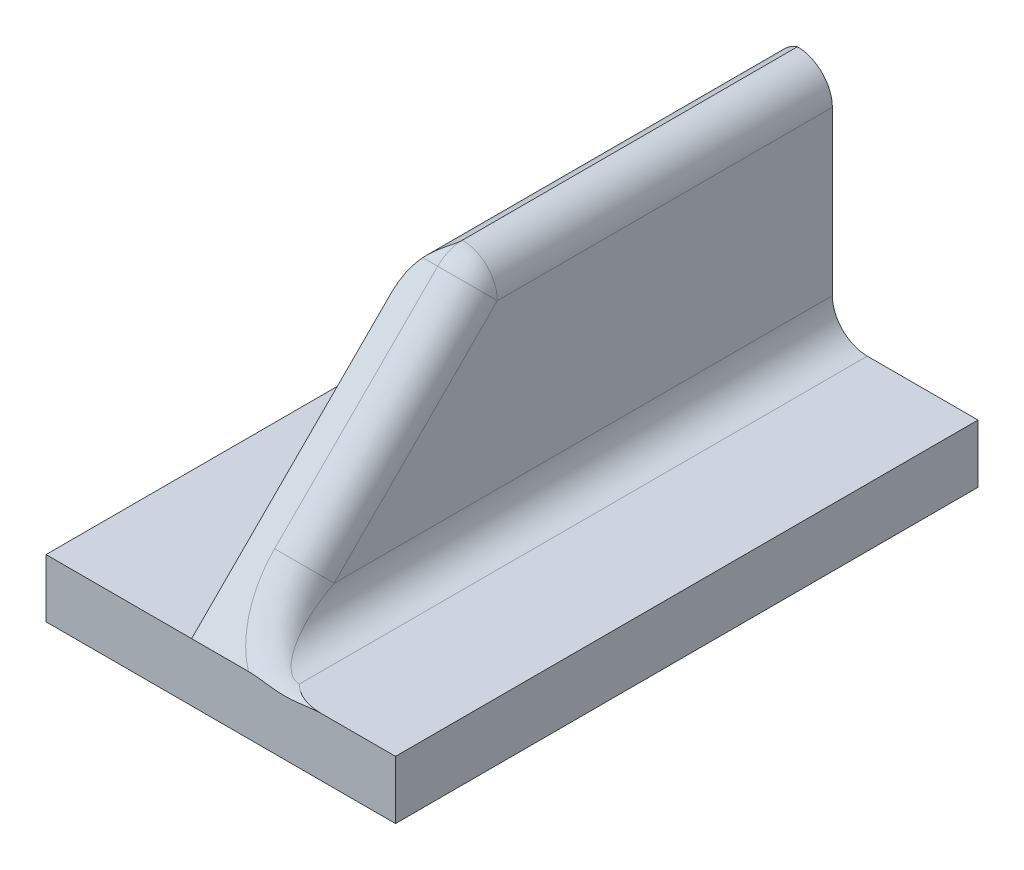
ISO-10303-21;
HEADER;
FILE_DESCRIPTION(('STEP AP214'),'2;1');
FILE_NAME('part.step','',(''),(''),'','','');
FILE_SCHEMA(('AUTOMOTIVE_DESIGN { 1 0 10303 214 1 1 1 1 }'));
ENDSEC;
DATA;
#1=APPLICATION_CONTEXT('core data for automotive mechanical design processes');
#2=APPLICATION_PROTOCOL_DEFINITION('international standard','automotive_design',2000,#1);
#3=PRODUCT_CONTEXT('',#1,'mechanical');
#4=PRODUCT('Part','Part','',(#3));
#5=PRODUCT_RELATED_PRODUCT_CATEGORY('part','',(#4));
#6=PRODUCT_DEFINITION_FORMATION('','',#4);
#7=PRODUCT_DEFINITION_CONTEXT('part definition',#1,'design');
#8=PRODUCT_DEFINITION('design','',#6,#7);
#9=PRODUCT_DEFINITION_SHAPE('','',#8);
#10=(LENGTH_UNIT() NAMED_UNIT(*) SI_UNIT(.MILLI.,.METRE.));
#11=(NAMED_UNIT(*) PLANE_ANGLE_UNIT() SI_UNIT($,.RADIAN.));
#12=(NAMED_UNIT(*) SI_UNIT($,.STERADIAN.) SOLID_ANGLE_UNIT());
#13=UNCERTAINTY_MEASURE_WITH_UNIT(LENGTH_MEASURE(1.E-05),#10,'distance_accuracy_value','');
#14=(GEOMETRIC_REPRESENTATION_CONTEXT(3) GLOBAL_UNCERTAINTY_ASSIGNED_CONTEXT((#13)) GLOBAL_UNIT_ASSIGNED_CONTEXT((#10,
#11,#12)) REPRESENTATION_CONTEXT('',''));
#15=CARTESIAN_POINT('',(0.,0.,0.));
#16=DIRECTION('',(0.,0.,1.));
#17=DIRECTION('',(1.,0.,0.));
#18=AXIS2_PLACEMENT_3D('',#15,#16,#17);
#19=CARTESIAN_POINT('',(-15.,5.,0.));
#20=DIRECTION('',(0.,1.,0.));
#21=DIRECTION('',(0.,0.,1.));
#22=AXIS2_PLACEMENT_3D('',#19,#20,#21);
#23=PLANE('',#22);
#24=DIRECTION('',(1.,0.,0.));
#25=VECTOR('',#24,1.);
#26=CARTESIAN_POINT('',(-15.,5.,0.));
#27=LINE('',#26,#25);
#28=CARTESIAN_POINT('',(-15.,5.,0.));
#29=VERTEX_POINT('',#28);
#30=CARTESIAN_POINT('',(-2.5,5.,0.));
#31=VERTEX_POINT('',#30);
#32=EDGE_CURVE('E144',#29,#31,#27,.T.);
#33=ORIENTED_EDGE('',*,*,#32,.T.);
#34=DIRECTION('',(0.,0.,-1.));
#35=VECTOR('',#34,1.);
#36=CARTESIAN_POINT('',(-2.5,5.,-50.));
#37=LINE('',#36,#35);
#38=CARTESIAN_POINT('',(-2.5,5.,-50.));
#39=VERTEX_POINT('',#38);
#40=EDGE_CURVE('E266',#31,#39,#37,.T.);
#41=ORIENTED_EDGE('',*,*,#40,.T.);
#42=DIRECTION('',(-1.,0.,0.));
#43=VECTOR('',#42,1.);
#44=CARTESIAN_POINT('',(-15.,5.,-50.));
#45=LINE('',#44,#43);
#46=CARTESIAN_POINT('',(-15.,5.,-50.));
#47=VERTEX_POINT('',#46);
#48=EDGE_CURVE('E182',#39,#47,#45,.T.);
#49=ORIENTED_EDGE('',*,*,#48,.T.);
#50=DIRECTION('',(0.,0.,1.));
#51=VECTOR('',#50,1.);
#52=CARTESIAN_POINT('',(-15.,5.,-50.));
#53=LINE('',#52,#51);
#54=EDGE_CURVE('E165',#47,#29,#53,.T.);
#55=ORIENTED_EDGE('',*,*,#54,.T.);
#56=EDGE_LOOP('',(#33,#41,#49,#55));
#57=FACE_BOUND('',#56,.T.);
#58=ADVANCED_FACE('F35',(#57),#23,.T.);
#59=CARTESIAN_POINT('',(-15.,5.,-50.));
#60=DIRECTION('',(1.,0.,0.));
#61=DIRECTION('',(0.,0.,-1.));
#62=AXIS2_PLACEMENT_3D('',#59,#60,#61);
#63=PLANE('',#62);
#64=DIRECTION('',(0.,0.,1.));
#65=VECTOR('',#64,1.);
#66=CARTESIAN_POINT('',(-15.,0.,-50.));
#67=LINE('',#66,#65);
#68=CARTESIAN_POINT('',(-15.,0.,-50.));
#69=VERTEX_POINT('',#68);
#70=CARTESIAN_POINT('',(-15.,0.,0.));
#71=VERTEX_POINT('',#70);
#72=EDGE_CURVE('E132',#69,#71,#67,.T.);
#73=ORIENTED_EDGE('',*,*,#72,.T.);
#74=DIRECTION('',(0.,-1.,0.));
#75=VECTOR('',#74,1.);
#76=CARTESIAN_POINT('',(-15.,5.,0.));
#77=LINE('',#76,#75);
#78=EDGE_CURVE('E139',#29,#71,#77,.T.);
#79=ORIENTED_EDGE('',*,*,#78,.F.);
#80=ORIENTED_EDGE('',*,*,#54,.F.);
#81=DIRECTION('',(0.,-1.,0.));
#82=VECTOR('',#81,1.);
#83=CARTESIAN_POINT('',(-15.,5.,-50.));
#84=LINE('',#83,#82);
#85=EDGE_CURVE('E153',#47,#69,#84,.T.);
#86=ORIENTED_EDGE('',*,*,#85,.T.);
#87=EDGE_LOOP('',(#73,#79,#80,#86));
#88=FACE_BOUND('',#87,.T.);
#89=ADVANCED_FACE('F37',(#88),#63,.F.);
#90=CARTESIAN_POINT('',(-15.,5.,0.));
#91=DIRECTION('',(0.,0.,-1.));
#92=DIRECTION('',(-1.,0.,0.));
#93=AXIS2_PLACEMENT_3D('',#90,#91,#92);
#94=PLANE('',#93);
#95=CARTESIAN_POINT('',(8.6260322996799,5.,0.));
#96=VERTEX_POINT('',#95);
#97=CARTESIAN_POINT('',(15.,5.,0.));
#98=VERTEX_POINT('',#97);
#99=EDGE_CURVE('E167',#96,#98,#27,.T.);
#100=ORIENTED_EDGE('',*,*,#99,.F.);
#101=CARTESIAN_POINT('',(5.5,5.,-1.24264068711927));
#102=CARTESIAN_POINT('',(5.5,5.,-0.645903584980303));
#103=CARTESIAN_POINT('',(5.5,4.77163859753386,-0.094590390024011));
#104=CARTESIAN_POINT('',(5.5,4.54327719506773,0.456722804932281));
#105=CARTESIAN_POINT('',(5.5,4.12132034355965,0.878679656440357));
#106=CARTESIAN_POINT('',(5.36873314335,5.,-1.24264068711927));
#107=CARTESIAN_POINT('',(5.34262431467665,5.,-0.645903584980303));
#108=CARTESIAN_POINT('',(5.3085083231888,4.77163859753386,-0.094590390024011));
#109=CARTESIAN_POINT('',(5.27439378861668,4.54327719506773,0.456722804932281));
#110=CARTESIAN_POINT('',(5.23746628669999,4.12132034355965,0.878679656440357));
#111=CARTESIAN_POINT('',(5.23746628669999,5.00867901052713,-1.25999870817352));
#112=CARTESIAN_POINT('',(5.18520339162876,5.01214442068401,-0.662743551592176));
#113=CARTESIAN_POINT('',(5.11701664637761,4.7859641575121,-0.111262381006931));
#114=CARTESIAN_POINT('',(5.04872272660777,4.55980027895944,0.440199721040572));
#115=CARTESIAN_POINT('',(4.97493257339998,4.1386783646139,0.861321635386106));
#116=CARTESIAN_POINT('',(4.97722405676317,5.04293515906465,-1.32851100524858));
#117=CARTESIAN_POINT('',(4.87412474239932,5.05998251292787,-0.729154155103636));
#118=CARTESIAN_POINT('',(4.73812978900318,4.84246050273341,-0.177045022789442));
#119=CARTESIAN_POINT('',(4.60202629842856,4.6249542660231,0.375045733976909));
#120=CARTESIAN_POINT('',(4.45444811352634,4.20719066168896,0.792809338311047));
#121=CARTESIAN_POINT('',(4.84832342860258,5.06879174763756,-1.38022418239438));
#122=CARTESIAN_POINT('',(4.7204896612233,5.09609278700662,-0.779303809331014));
#123=CARTESIAN_POINT('',(4.5508562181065,4.88509176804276,-0.226692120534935));
#124=CARTESIAN_POINT('',(4.3810202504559,4.67415316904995,0.325846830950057));
#125=CARTESIAN_POINT('',(4.19664685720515,4.25890383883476,0.741096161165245));
#126=CARTESIAN_POINT('',(4.59489959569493,5.13668817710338,-1.51601704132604));
#127=CARTESIAN_POINT('',(4.42032818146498,5.19063971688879,-0.910859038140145));
#128=CARTESIAN_POINT('',(4.18415149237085,4.99688329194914,-0.35698758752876));
#129=CARTESIAN_POINT('',(3.94776015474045,4.8031916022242,0.196808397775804));
#130=CARTESIAN_POINT('',(3.68979919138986,4.39469669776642,0.605303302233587));
#131=CARTESIAN_POINT('',(4.47063542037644,5.17920420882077,-1.60104910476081));
#132=CARTESIAN_POINT('',(4.27410606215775,5.24978259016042,-0.993253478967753));
#133=CARTESIAN_POINT('',(4.00514256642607,5.06682392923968,-0.438548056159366));
#134=CARTESIAN_POINT('',(3.73589604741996,4.88400051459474,0.115999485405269));
#135=CARTESIAN_POINT('',(3.44127084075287,4.47972876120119,0.520271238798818));
#136=CARTESIAN_POINT('',(4.22839948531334,5.27953337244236,-1.80170743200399));
#137=CARTESIAN_POINT('',(3.9918164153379,5.38881898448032,-1.18746658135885));
#138=CARTESIAN_POINT('',(3.65839985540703,5.23155141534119,-0.630863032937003));
#139=CARTESIAN_POINT('',(3.32467556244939,5.07442921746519,-0.0744292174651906));
#140=CARTESIAN_POINT('',(2.95679897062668,4.68038708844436,0.319612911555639));
#141=CARTESIAN_POINT('',(4.11089437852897,5.33790205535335,-1.91844479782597));
#142=CARTESIAN_POINT('',(3.85637772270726,5.46952765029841,-1.30044303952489));
#143=CARTESIAN_POINT('',(3.49142891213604,5.32723912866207,-0.742677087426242));
#144=CARTESIAN_POINT('',(3.12613542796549,5.18518249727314,-0.185182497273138));
#145=CARTESIAN_POINT('',(2.72178875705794,4.79712445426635,0.202875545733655));
#146=CARTESIAN_POINT('',(3.88398177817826,5.46890362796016,-2.1804479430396));
#147=CARTESIAN_POINT('',(3.59846684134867,5.64980959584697,-1.55367953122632));
#148=CARTESIAN_POINT('',(3.17196151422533,5.54145572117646,-0.993369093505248));
#149=CARTESIAN_POINT('',(2.74507681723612,5.43335542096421,-0.433355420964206));
#150=CARTESIAN_POINT('',(2.26796355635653,5.05912759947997,-0.0591275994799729));
#151=CARTESIAN_POINT('',(3.77519929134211,5.54207098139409,-2.32678264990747));
#152=CARTESIAN_POINT('',(3.47688277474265,5.75015186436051,-1.69505880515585));
#153=CARTESIAN_POINT('',(3.02049031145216,5.66083568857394,-1.13325881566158));
#154=CARTESIAN_POINT('',(2.5637144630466,5.57186835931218,-0.571868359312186));
#155=CARTESIAN_POINT('',(2.05039858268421,5.20546230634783,-0.205462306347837));
#156=CARTESIAN_POINT('',(3.56745596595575,5.70147376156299,-2.64558821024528));
#157=CARTESIAN_POINT('',(3.24927897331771,5.96748673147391,-2.00261528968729));
#158=CARTESIAN_POINT('',(2.73501616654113,5.92008497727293,-1.43761590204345));
#159=CARTESIAN_POINT('',(2.2203304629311,5.87306655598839,-0.873066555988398));
#160=CARTESIAN_POINT('',(1.63491193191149,5.52426786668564,-0.524267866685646));
#161=CARTESIAN_POINT('',(3.46919831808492,5.78816215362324,-2.81896499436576));
#162=CARTESIAN_POINT('',(3.14429200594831,6.08510911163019,-2.1697470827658));
#163=CARTESIAN_POINT('',(2.60217084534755,6.06065417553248,-1.60293012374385));
#164=CARTESIAN_POINT('',(2.05965459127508,6.03668086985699,-1.036680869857));
#165=CARTESIAN_POINT('',(1.43839663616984,5.69764465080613,-0.697644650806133));
#166=CARTESIAN_POINT('',(3.28413311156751,5.97322499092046,-3.18909066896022));
#167=CARTESIAN_POINT('',(2.95222435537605,6.33443592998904,-2.52592807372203));
#168=CARTESIAN_POINT('',(2.35669481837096,6.35954928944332,-1.95524822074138));
#169=CARTESIAN_POINT('',(1.76073162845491,6.38519008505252,-1.38519008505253));
#170=CARTESIAN_POINT('',(1.06826622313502,6.06777032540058,-1.06777032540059));
#171=CARTESIAN_POINT('',(3.19802961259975,6.07194779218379,-3.38653627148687));
#172=CARTESIAN_POINT('',(2.86620630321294,6.4665969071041,-2.71571801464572));
#173=CARTESIAN_POINT('',(2.24522666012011,6.51838700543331,-2.14288990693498));
#174=CARTESIAN_POINT('',(1.62387080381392,6.57080167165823,-1.57080167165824));
#175=CARTESIAN_POINT('',(0.896059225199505,6.26521592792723,-1.26521592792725));
#176=CARTESIAN_POINT('',(3.03876626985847,6.27950286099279,-3.80164640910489));
#177=CARTESIAN_POINT('',(2.71408341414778,6.74207597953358,-3.11391694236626));
#178=CARTESIAN_POINT('',(2.04492043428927,6.85069638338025,-2.53655427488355));
#179=CARTESIAN_POINT('',(1.37534854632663,6.9599947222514,-1.95999472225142));
#180=CARTESIAN_POINT('',(0.577532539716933,6.68032606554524,-1.68032606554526));
#181=CARTESIAN_POINT('',(2.96625192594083,6.38858040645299,-4.01980150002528));
#182=CARTESIAN_POINT('',(2.64897969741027,6.88568368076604,-3.32285549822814));
#183=CARTESIAN_POINT('',(1.95714998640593,7.02449824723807,-2.7430102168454));
#184=CARTESIAN_POINT('',(1.2649961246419,7.16408362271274,-2.16408362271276));
#185=CARTESIAN_POINT('',(0.432503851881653,6.89848115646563,-1.89848115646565));
#186=CARTESIAN_POINT('',(2.83548076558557,6.61508268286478,-4.47280605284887));
#187=CARTESIAN_POINT('',(2.54026718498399,7.18080116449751,-3.75564728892));
#188=CARTESIAN_POINT('',(1.80622847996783,7.3832448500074,-3.17058862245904));
#189=CARTESIAN_POINT('',(1.07184197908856,7.58651496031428,-2.58651496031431));
#190=CARTESIAN_POINT('',(0.170961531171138,7.35148570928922,-2.35148570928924));
#191=CARTESIAN_POINT('',(2.77777106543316,6.73266394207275,-4.7079685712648));
#192=CARTESIAN_POINT('',(2.49753470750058,7.33246226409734,-3.97984945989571));
#193=CARTESIAN_POINT('',(1.7439816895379,7.5683680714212,-3.39197011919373));
#194=CARTESIAN_POINT('',(0.990190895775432,7.80518636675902,-2.80518636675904));
#195=CARTESIAN_POINT('',(0.0555421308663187,7.58664822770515,-2.58664822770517));
#196=CARTESIAN_POINT('',(2.67770382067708,6.97424821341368,-5.19113711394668));
#197=CARTESIAN_POINT('',(2.43463439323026,7.64015233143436,-4.43909750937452));
#198=CARTESIAN_POINT('',(1.6455795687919,7.94594493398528,-3.84532075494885));
#199=CARTESIAN_POINT('',(0.856273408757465,8.25270180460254,-3.25270180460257));
#200=CARTESIAN_POINT('',(-0.14459235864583,8.06981677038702,-3.06981677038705));
#201=CARTESIAN_POINT('',(2.63577083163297,7.09833841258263,-5.43931751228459));
#202=CARTESIAN_POINT('',(2.41517910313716,7.79623317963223,-4.67435413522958));
#203=CARTESIAN_POINT('',(1.61012292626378,8.1384656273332,-4.07741608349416));
#204=CARTESIAN_POINT('',(0.804948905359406,8.48173905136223,-3.48173905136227));
#205=CARTESIAN_POINT('',(-0.228458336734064,8.31799716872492,-3.31799716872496));
#206=CARTESIAN_POINT('',(2.56810190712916,7.35088319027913,-5.94440706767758));
#207=CARTESIAN_POINT('',(2.39931197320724,8.10901838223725,-5.15133125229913));
#208=CARTESIAN_POINT('',(1.56617364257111,8.52676804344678,-4.54781000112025));
#209=CARTESIAN_POINT('',(0.732912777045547,8.94560053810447,-3.94560053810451));
#210=CARTESIAN_POINT('',(-0.363796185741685,8.82308672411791,-3.82308672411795));
#211=CARTESIAN_POINT('',(2.5426544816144,7.47937610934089,-6.20139290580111));
#212=CARTESIAN_POINT('',(2.40342869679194,8.26571754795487,-5.39317005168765));
#213=CARTESIAN_POINT('',(1.55815130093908,8.72254937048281,-4.78614686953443));
#214=CARTESIAN_POINT('',(0.712906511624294,9.18052840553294,-4.18052840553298));
#215=CARTESIAN_POINT('',(-0.414691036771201,9.08007256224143,-4.08007256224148));
#216=CARTESIAN_POINT('',(2.50853070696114,7.73857301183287,-6.71978671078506));
#217=CARTESIAN_POINT('',(2.43452134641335,8.57586819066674,-5.87869234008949));
#218=CARTESIAN_POINT('',(1.56926839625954,9.11312383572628,-5.26440413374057));
#219=CARTESIAN_POINT('',(0.704048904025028,9.65155327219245,-4.65155327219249));
#220=CARTESIAN_POINT('',(-0.482938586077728,9.59846636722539,-4.59846636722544));
#221=CARTESIAN_POINT('',(2.50000000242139,7.86928650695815,-6.98121370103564));
#222=CARTESIAN_POINT('',(2.46183593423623,8.72930012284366,-6.12244702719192));
#223=CARTESIAN_POINT('',(1.58864127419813,9.30789411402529,-5.50432058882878));
#224=CARTESIAN_POINT('',(0.71565447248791,9.88771022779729,-4.88771022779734));
#225=CARTESIAN_POINT('',(-0.499999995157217,9.85989335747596,-4.85989335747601));
#226=CARTESIAN_POINT('',(2.49999999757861,8.13071349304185,-7.50406767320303));
#227=CARTESIAN_POINT('',(2.53840836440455,9.02901540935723,-6.60702103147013));
#228=CARTESIAN_POINT('',(1.65399941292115,9.69210588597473,-5.98096078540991));
#229=CARTESIAN_POINT('',(0.769799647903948,10.3564258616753,-5.35642586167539));
#230=CARTESIAN_POINT('',(-0.500000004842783,10.3827473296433,-5.3827473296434));
#231=CARTESIAN_POINT('',(2.50853069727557,8.26142698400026,-7.76549465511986));
#232=CARTESIAN_POINT('',(2.58782085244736,9.1753065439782,-6.84790830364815));
#233=CARTESIAN_POINT('',(1.69998467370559,9.88154737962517,-6.21768452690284));
#234=CARTESIAN_POINT('',(0.812547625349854,10.5890453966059,-5.58904539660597));
#235=CARTESIAN_POINT('',(-0.48293860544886,10.6441743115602,-5.64417431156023));
#236=CARTESIAN_POINT('',(2.54265449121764,8.52062389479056,-8.28388847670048));
#237=CARTESIAN_POINT('',(2.70687280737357,9.4569238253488,-7.32189479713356));
#238=CARTESIAN_POINT('',(1.81719680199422,10.250771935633,-6.68309542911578));
#239=CARTESIAN_POINT('',(0.927915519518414,11.0458635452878,-6.04586354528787));
#240=CARTESIAN_POINT('',(-0.414691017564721,11.1625681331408,-6.16256813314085));
#241=CARTESIAN_POINT('',(2.56810194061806,8.64911682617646,-8.54087433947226));
#242=CARTESIAN_POINT('',(2.77650015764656,9.59232484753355,-7.55510126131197));
#243=CARTESIAN_POINT('',(1.88820579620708,10.4306234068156,-6.9118337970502));
#244=CARTESIAN_POINT('',(1.00050561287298,11.2701671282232,-6.27016712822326));
#245=CARTESIAN_POINT('',(-0.363796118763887,11.4195539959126,-6.41955399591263));
#246=CARTESIAN_POINT('',(2.63577079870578,8.90166157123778,-9.04596382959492));
#247=CARTESIAN_POINT('',(2.93339458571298,9.84856905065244,-8.00890411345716));
#248=CARTESIAN_POINT('',(2.05319352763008,10.7764725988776,-7.35646714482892));
#249=CARTESIAN_POINT('',(1.1735701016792,11.7055873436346,-6.70558734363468));
#250=CARTESIAN_POINT('',(-0.228458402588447,11.9246434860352,-6.92464348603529));
#251=CARTESIAN_POINT('',(2.67770369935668,9.02575172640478,-9.29414413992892));
#252=CARTESIAN_POINT('',(3.02051282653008,9.96959060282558,-8.22968838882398));
#253=CARTESIAN_POINT('',(2.14676701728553,10.9426520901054,-7.57251319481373));
#254=CARTESIAN_POINT('',(1.27379842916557,11.9168948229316,-6.91689482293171));
#255=CARTESIAN_POINT('',(-0.144592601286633,12.1728237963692,-7.17282379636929));
#256=CARTESIAN_POINT('',(2.7777711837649,9.26733611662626,-9.77731292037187));
#257=CARTESIAN_POINT('',(3.20886189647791,10.1938837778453,-8.65398543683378));
#258=CARTESIAN_POINT('',(2.35362808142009,11.2572540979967,-7.98712523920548));
#259=CARTESIAN_POINT('',(1.49913723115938,12.3217551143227,-7.32175511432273));
#260=CARTESIAN_POINT('',(0.0555423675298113,12.6559925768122,-7.65599257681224));
#261=CARTESIAN_POINT('',(2.8354812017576,9.38491753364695,-10.0124757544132));
#262=CARTESIAN_POINT('',(3.30985278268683,10.2974671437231,-8.85780599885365));
#263=CARTESIAN_POINT('',(2.46637322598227,11.4060132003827,-8.18599073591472));
#264=CARTESIAN_POINT('',(1.62382235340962,12.5156236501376,-7.51562365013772));
#265=CARTESIAN_POINT('',(0.170962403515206,12.8911554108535,-7.89115541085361));
#266=CARTESIAN_POINT('',(2.96625150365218,9.61141938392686,-10.4654794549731));
#267=CARTESIAN_POINT('',(3.52142684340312,10.4843300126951,-9.24384934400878));
#268=CARTESIAN_POINT('',(2.70726153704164,11.6823766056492,-8.56195543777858));
#269=CARTESIAN_POINT('',(1.89397045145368,12.8814271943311,-7.88142719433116));
#270=CARTESIAN_POINT('',(0.432503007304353,13.3441591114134,-8.34415911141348));
#271=CARTESIAN_POINT('',(3.03876471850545,9.72049636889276,-10.6836334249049));
#272=CARTESIAN_POINT('',(3.63174299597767,10.5680717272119,-9.4265334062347));
#273=CARTESIAN_POINT('',(2.83480035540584,11.8105035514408,-8.73954598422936));
#274=CARTESIAN_POINT('',(2.03888556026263,13.0538349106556,-8.0538349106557));
#275=CARTESIAN_POINT('',(0.577529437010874,13.5623130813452,-8.56231308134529));
#276=CARTESIAN_POINT('',(3.19803110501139,9.92805294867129,-11.0987465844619));
#277=CARTESIAN_POINT('',(3.85646675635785,10.7136539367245,-9.76656560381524));
#278=CARTESIAN_POINT('',(3.09988462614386,12.043007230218,-9.06928810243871));
#279=CARTESIAN_POINT('',(2.34425584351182,13.3731986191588,-8.37319861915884));
#280=CARTESIAN_POINT('',(0.896062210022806,13.9774262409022,-8.9774262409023));
#281=CARTESIAN_POINT('',(3.28413857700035,10.0267777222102,-11.2961961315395));
#282=CARTESIAN_POINT('',(3.97066229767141,10.7761011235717,-9.92454831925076));
#283=CARTESIAN_POINT('',(3.23686578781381,12.1481013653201,-9.22214983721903));
#284=CARTESIAN_POINT('',(2.50412038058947,13.5208008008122,-8.52080080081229));
#285=CARTESIAN_POINT('',(1.06827715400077,14.1748757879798,-9.17487578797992));
#286=CARTESIAN_POINT('',(3.46919308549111,10.2118352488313,-11.666311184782));
#287=CARTESIAN_POINT('',(4.19681018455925,10.8788894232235,-10.2123686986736));
#288=CARTESIAN_POINT('',(3.51445195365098,12.3331524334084,-9.49973076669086));
#289=CARTESIAN_POINT('',(2.83306119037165,13.7880618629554,-8.78806186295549));
#290=CARTESIAN_POINT('',(1.43838617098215,14.5449908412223,-9.5449908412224));
#291=CARTESIAN_POINT('',(3.56743684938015,10.2985167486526,-11.839674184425));
#292=CARTESIAN_POINT('',(4.30869578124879,10.9199378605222,-10.3430061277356));
#293=CARTESIAN_POINT('',(3.65465396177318,12.4139895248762,-9.62537145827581));
#294=CARTESIAN_POINT('',(3.00160398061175,13.9085266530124,-8.90852665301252));
#295=CARTESIAN_POINT('',(1.63487369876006,14.7183538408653,-9.7183538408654));
#296=CARTESIAN_POINT('',(3.77521754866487,10.457938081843,-12.1585168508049));
#297=CARTESIAN_POINT('',(4.52360422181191,10.9815836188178,-10.5747673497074));
#298=CARTESIAN_POINT('',(3.9318549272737,12.5508503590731,-9.84730390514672));
#299=CARTESIAN_POINT('',(3.34100707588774,14.1205662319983,-9.12056623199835));
#300=CARTESIAN_POINT('',(2.05043509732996,15.0371965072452,-10.0371965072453));
#301=CARTESIAN_POINT('',(3.88404839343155,10.5311294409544,-12.3048995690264));
#302=CARTESIAN_POINT('',(4.62677370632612,11.0028975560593,-10.676800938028));
#303=CARTESIAN_POINT('',(4.06871460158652,12.6078260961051,-9.94466100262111));
#304=CARTESIAN_POINT('',(3.51148447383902,14.2130445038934,-9.21304450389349));
#305=CARTESIAN_POINT('',(2.26809678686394,15.1835792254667,-10.1835792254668));
#306=CARTESIAN_POINT('',(4.05546917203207,10.6301023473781,-12.5028453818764));
#307=CARTESIAN_POINT('',(4.77124464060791,11.0227117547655,-10.8088337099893));
#308=CARTESIAN_POINT('',(4.26813431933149,12.6770988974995,-10.0701322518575));
#309=CARTESIAN_POINT('',(3.76521996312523,14.3315531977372,-9.33155319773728));
#310=CARTESIAN_POINT('',(2.61093834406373,15.3815250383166,-10.3815250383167));
#311=CARTESIAN_POINT('',(4.11256792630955,10.6606994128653,-12.5640395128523));
#312=CARTESIAN_POINT('',(4.81683559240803,11.0273096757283,-10.8487101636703));
#313=CARTESIAN_POINT('',(4.33221288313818,12.6971989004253,-10.1078753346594));
#314=CARTESIAN_POINT('',(3.84776796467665,14.3671381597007,-9.36713815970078));
#315=CARTESIAN_POINT('',(2.72513585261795,15.4427191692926,-10.4427191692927));
#316=CARTESIAN_POINT('',(4.22993056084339,10.7186765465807,-12.6799937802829));
#317=CARTESIAN_POINT('',(4.90488120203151,11.0333708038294,-10.9225339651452));
#318=CARTESIAN_POINT('',(4.45875607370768,12.7329863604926,-10.1775443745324));
#319=CARTESIAN_POINT('',(4.01280704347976,14.4326519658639,-9.43265196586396));
#320=CARTESIAN_POINT('',(2.95986112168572,15.5586734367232,-10.5586734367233));
#321=CARTESIAN_POINT('',(4.29019302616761,10.7460580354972,-12.7347567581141));
#322=CARTESIAN_POINT('',(4.94731891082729,11.0348259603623,-10.9564593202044));
#323=CARTESIAN_POINT('',(4.52122140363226,12.7486757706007,-10.2094729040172));
#324=CARTESIAN_POINT('',(4.09528008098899,14.4625603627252,-9.46256036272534));
#325=CARTESIAN_POINT('',(3.08038605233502,15.6134364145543,-10.6134364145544));
#326=CARTESIAN_POINT('',(4.41129737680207,10.796221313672,-12.8350833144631));
#327=CARTESIAN_POINT('',(5.0268797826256,11.035233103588,-11.0171026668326));
#328=CARTESIAN_POINT('',(4.64150612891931,12.7754489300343,-10.2663655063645));
#329=CARTESIAN_POINT('',(4.25627782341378,14.515697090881,-9.5156970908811));
#330=CARTESIAN_POINT('',(3.32259475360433,15.7137629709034,-10.7137629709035));
#331=CARTESIAN_POINT('',(4.47202496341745,10.8191408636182,-12.8809224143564));
#332=CARTESIAN_POINT('',(5.06413041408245,11.0342746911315,-11.0440312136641));
#333=CARTESIAN_POINT('',(4.69941170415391,12.7866884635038,-10.2915526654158));
#334=CARTESIAN_POINT('',(4.33481596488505,14.5391230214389,-9.53912302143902));
#335=CARTESIAN_POINT('',(3.44404992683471,15.7596020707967,-10.7596020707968));
#336=CARTESIAN_POINT('',(4.59598966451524,10.86130212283,-12.9652449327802));
#337=CARTESIAN_POINT('',(5.1348792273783,11.0308030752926,-11.0924130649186));
#338=CARTESIAN_POINT('',(4.81273574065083,12.8058672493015,-10.3366581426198));
#339=CARTESIAN_POINT('',(4.49071546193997,14.5809523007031,-9.58095230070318));
#340=CARTESIAN_POINT('',(3.69197932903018,15.8439245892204,-10.8439245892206));
#341=CARTESIAN_POINT('',(4.65922664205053,10.8805440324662,-13.0037287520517));
#342=CARTESIAN_POINT('',(5.16835801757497,11.028287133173,-11.1138469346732));
#343=CARTESIAN_POINT('',(4.86815433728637,12.8138066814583,-10.3565767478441));
#344=CARTESIAN_POINT('',(4.56804913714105,14.599338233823,-9.59933823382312));
#345=CARTESIAN_POINT('',(3.81845328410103,15.882408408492,-10.8824084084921));
#346=CARTESIAN_POINT('',(4.78593811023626,10.9144962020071,-13.0716330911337));
#347=CARTESIAN_POINT('',(5.23063174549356,11.0226481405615,-11.1508479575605));
#348=CARTESIAN_POINT('',(4.9747466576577,12.8267613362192,-10.3908519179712));
#349=CARTESIAN_POINT('',(4.71895468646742,14.6308858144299,-9.63088581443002));
#350=CARTESIAN_POINT('',(4.07187622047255,15.950312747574,-10.9503127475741));
#351=CARTESIAN_POINT('',(4.84934909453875,10.9293246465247,-13.1012899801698));
#352=CARTESIAN_POINT('',(5.25952070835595,11.0195451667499,-11.16655647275));
#353=CARTESIAN_POINT('',(5.02599772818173,12.8318568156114,-10.4053568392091));
#354=CARTESIAN_POINT('',(4.79254402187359,14.6441741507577,-9.64417415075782));
#355=CARTESIAN_POINT('',(4.19869818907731,15.97996963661,-10.9799696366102));
#356=CARTESIAN_POINT('',(4.97779247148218,10.9549257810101,-13.1524922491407));
#357=CARTESIAN_POINT('',(5.31416701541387,11.0134963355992,-11.1932041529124));
#358=CARTESIAN_POINT('',(5.12621348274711,12.8400454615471,-10.4298936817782));
#359=CARTESIAN_POINT('',(4.93832943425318,14.6666002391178,-9.66660023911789));
#360=CARTESIAN_POINT('',(4.45558494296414,16.031171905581,-11.0311719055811));
#361=CARTESIAN_POINT('',(5.04282479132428,10.965698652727,-13.1740379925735));
#362=CARTESIAN_POINT('',(5.33990879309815,11.010551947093,-11.2041313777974));
#363=CARTESIAN_POINT('',(5.17517826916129,12.8431387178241,-10.4399258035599));
#364=CARTESIAN_POINT('',(5.01049332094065,14.6757277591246,-9.6757277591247));
#365=CARTESIAN_POINT('',(4.58564958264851,16.0527176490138,-11.0527176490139));
#366=CARTESIAN_POINT('',(5.17293308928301,10.982827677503,-13.2082960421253));
#367=CARTESIAN_POINT('',(5.38863046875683,11.0055729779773,-11.2213045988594));
#368=CARTESIAN_POINT('',(5.27055016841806,12.8477957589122,-10.455658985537));
#369=CARTESIAN_POINT('',(5.15251407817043,14.6900206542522,-9.69002065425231));
#370=CARTESIAN_POINT('',(4.84586617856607,16.0869756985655,-11.0869756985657));
#371=CARTESIAN_POINT('',(5.2379905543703,10.9892539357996,-13.2211485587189));
#372=CARTESIAN_POINT('',(5.4116364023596,11.0035260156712,-11.2276172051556));
#373=CARTESIAN_POINT('',(5.31698618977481,12.8493839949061,-10.461428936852));
#374=CARTESIAN_POINT('',(5.222357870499,14.6952424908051,-9.69524249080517));
#375=CARTESIAN_POINT('',(4.97598110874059,16.0998282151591,-11.0998282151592));
#376=CARTESIAN_POINT('',(5.36869850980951,10.9978410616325,-13.2383228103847));
#377=CARTESIAN_POINT('',(5.45643428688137,11.0007385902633,-11.2360202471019));
#378=CARTESIAN_POINT('',(5.40894842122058,12.8514612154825,-10.4691013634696));
#379=CARTESIAN_POINT('',(5.361484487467,14.7021843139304,-9.70218431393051));
#380=CARTESIAN_POINT('',(5.23739701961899,16.117002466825,-11.1170024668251));
#381=CARTESIAN_POINT('',(5.43434925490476,11.,-13.2426406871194));
#382=CARTESIAN_POINT('',(5.47821452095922,11.,-11.2381047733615));
#383=CARTESIAN_POINT('',(5.45447421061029,12.8519497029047,-10.4710020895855));
#384=CARTESIAN_POINT('',(5.43073390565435,14.7038994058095,-9.70389940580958));
#385=CARTESIAN_POINT('',(5.36869850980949,16.1213203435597,-11.1213203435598));
#386=CARTESIAN_POINT('',(5.56565074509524,11.,-13.2426406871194));
#387=CARTESIAN_POINT('',(5.52178547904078,11.,-11.2381047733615));
#388=CARTESIAN_POINT('',(5.54552578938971,12.8519497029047,-10.4710020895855));
#389=CARTESIAN_POINT('',(5.56926609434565,14.7038994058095,-9.70389940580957));
#390=CARTESIAN_POINT('',(5.63130149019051,16.1213203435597,-11.1213203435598));
#391=CARTESIAN_POINT('',(5.63130149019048,10.9978410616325,-13.2383228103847));
#392=CARTESIAN_POINT('',(5.54356571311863,11.0007385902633,-11.2360202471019));
#393=CARTESIAN_POINT('',(5.59105157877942,12.8514612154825,-10.4691013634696));
#394=CARTESIAN_POINT('',(5.638515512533,14.7021843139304,-9.70218431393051));
#395=CARTESIAN_POINT('',(5.76260298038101,16.117002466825,-11.1170024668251));
#396=CARTESIAN_POINT('',(5.7620094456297,10.9892539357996,-13.2211485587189));
#397=CARTESIAN_POINT('',(5.5883635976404,11.0035260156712,-11.2276172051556));
#398=CARTESIAN_POINT('',(5.68301381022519,12.8493839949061,-10.4614289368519));
#399=CARTESIAN_POINT('',(5.777642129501,14.6952424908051,-9.69524249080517));
#400=CARTESIAN_POINT('',(6.0240188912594,16.0998282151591,-11.0998282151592));
#401=CARTESIAN_POINT('',(5.82706691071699,10.982827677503,-13.2082960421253));
#402=CARTESIAN_POINT('',(5.61136953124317,11.0055729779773,-11.2213045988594));
#403=CARTESIAN_POINT('',(5.72944983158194,12.8477957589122,-10.455658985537));
#404=CARTESIAN_POINT('',(5.84748592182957,14.6900206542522,-9.69002065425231));
#405=CARTESIAN_POINT('',(6.15413382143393,16.0869756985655,-11.0869756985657));
#406=CARTESIAN_POINT('',(5.95717520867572,10.965698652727,-13.1740379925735));
#407=CARTESIAN_POINT('',(5.66009120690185,11.010551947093,-11.2041313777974));
#408=CARTESIAN_POINT('',(5.82482173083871,12.8431387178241,-10.4399258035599));
#409=CARTESIAN_POINT('',(5.98950667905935,14.6757277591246,-9.6757277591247));
#410=CARTESIAN_POINT('',(6.41435041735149,16.0527176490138,-11.0527176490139));
#411=CARTESIAN_POINT('',(6.02220752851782,10.9549257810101,-13.1524922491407));
#412=CARTESIAN_POINT('',(5.68583298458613,11.0134963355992,-11.1932041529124));
#413=CARTESIAN_POINT('',(5.87378651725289,12.8400454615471,-10.4298936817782));
#414=CARTESIAN_POINT('',(6.06167056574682,14.6666002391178,-9.66660023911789));
#415=CARTESIAN_POINT('',(6.54441505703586,16.0311719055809,-11.0311719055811));
#416=CARTESIAN_POINT('',(6.15065090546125,10.9293246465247,-13.1012899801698));
#417=CARTESIAN_POINT('',(5.74047929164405,11.0195451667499,-11.16655647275));
#418=CARTESIAN_POINT('',(5.97400227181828,12.8318568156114,-10.4053568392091));
#419=CARTESIAN_POINT('',(6.20745597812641,14.6441741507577,-9.64417415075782));
#420=CARTESIAN_POINT('',(6.80130181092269,15.97996963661,-10.9799696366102));
#421=CARTESIAN_POINT('',(6.21406188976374,10.9144962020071,-13.0716330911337));
#422=CARTESIAN_POINT('',(5.76936825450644,11.0226481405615,-11.1508479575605));
#423=CARTESIAN_POINT('',(6.0252533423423,12.8267613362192,-10.3908519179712));
#424=CARTESIAN_POINT('',(6.28104531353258,14.6308858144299,-9.63088581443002));
#425=CARTESIAN_POINT('',(6.92812377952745,15.950312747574,-10.9503127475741));
#426=CARTESIAN_POINT('',(6.34077335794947,10.8805440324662,-13.0037287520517));
#427=CARTESIAN_POINT('',(5.83164198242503,11.028287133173,-11.1138469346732));
#428=CARTESIAN_POINT('',(6.13184566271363,12.8138066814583,-10.3565767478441));
#429=CARTESIAN_POINT('',(6.43195086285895,14.599338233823,-9.59933823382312));
#430=CARTESIAN_POINT('',(7.18154671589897,15.882408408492,-10.8824084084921));
#431=CARTESIAN_POINT('',(6.40401033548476,10.86130212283,-12.9652449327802));
#432=CARTESIAN_POINT('',(5.8651207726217,11.0308030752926,-11.0924130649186));
#433=CARTESIAN_POINT('',(6.18726425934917,12.8058672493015,-10.3366581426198));
#434=CARTESIAN_POINT('',(6.50928453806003,14.5809523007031,-9.58095230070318));
#435=CARTESIAN_POINT('',(7.30802067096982,15.8439245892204,-10.8439245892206));
#436=CARTESIAN_POINT('',(6.52797503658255,10.8191408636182,-12.8809224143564));
#437=CARTESIAN_POINT('',(5.93586958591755,11.0342746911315,-11.0440312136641));
#438=CARTESIAN_POINT('',(6.30058829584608,12.7866884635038,-10.2915526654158));
#439=CARTESIAN_POINT('',(6.66518403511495,14.5391230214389,-9.53912302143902));
#440=CARTESIAN_POINT('',(7.55595007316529,15.7596020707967,-10.7596020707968));
#441=CARTESIAN_POINT('',(6.58870262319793,10.796221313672,-12.8350833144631));
#442=CARTESIAN_POINT('',(5.9731202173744,11.035233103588,-11.0171026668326));
#443=CARTESIAN_POINT('',(6.35849387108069,12.7754489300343,-10.2663655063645));
#444=CARTESIAN_POINT('',(6.74372217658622,14.515697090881,-9.51569709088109));
#445=CARTESIAN_POINT('',(7.67740524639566,15.7137629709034,-10.7137629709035));
#446=CARTESIAN_POINT('',(6.70980697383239,10.7460580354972,-12.7347567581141));
#447=CARTESIAN_POINT('',(6.0526810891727,11.0348259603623,-10.9564593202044));
#448=CARTESIAN_POINT('',(6.47877859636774,12.7486757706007,-10.2094729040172));
#449=CARTESIAN_POINT('',(6.90471991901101,14.4625603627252,-9.46256036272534));
#450=CARTESIAN_POINT('',(7.91961394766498,15.6134364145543,-10.6134364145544));
#451=CARTESIAN_POINT('',(6.77006943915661,10.7186765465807,-12.6799937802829));
#452=CARTESIAN_POINT('',(6.09511879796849,11.0333708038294,-10.9225339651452));
#453=CARTESIAN_POINT('',(6.54124392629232,12.7329863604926,-10.1775443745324));
#454=CARTESIAN_POINT('',(6.98719295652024,14.4326519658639,-9.43265196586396));
#455=CARTESIAN_POINT('',(8.04013887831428,15.5586734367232,-10.5586734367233));
#456=CARTESIAN_POINT('',(6.88743207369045,10.6606994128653,-12.5640395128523));
#457=CARTESIAN_POINT('',(6.18316440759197,11.0273096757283,-10.8487101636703));
#458=CARTESIAN_POINT('',(6.66778711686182,12.6971989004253,-10.1078753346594));
#459=CARTESIAN_POINT('',(7.15223203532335,14.3671381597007,-9.36713815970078));
#460=CARTESIAN_POINT('',(8.27486414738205,15.4427191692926,-10.4427191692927));
#461=CARTESIAN_POINT('',(6.94453082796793,10.6301023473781,-12.5028453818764));
#462=CARTESIAN_POINT('',(6.22875535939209,11.0227117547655,-10.8088337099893));
#463=CARTESIAN_POINT('',(6.73186568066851,12.6770988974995,-10.0701322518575));
#464=CARTESIAN_POINT('',(7.23478003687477,14.3315531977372,-9.33155319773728));
#465=CARTESIAN_POINT('',(8.38906165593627,15.3815250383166,-10.3815250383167));
#466=CARTESIAN_POINT('',(7.11595160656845,10.5311294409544,-12.3048995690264));
#467=CARTESIAN_POINT('',(6.37322629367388,11.0028975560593,-10.676800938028));
#468=CARTESIAN_POINT('',(6.93128539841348,12.6078260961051,-9.9446610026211));
#469=CARTESIAN_POINT('',(7.48851552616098,14.2130445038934,-9.21304450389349));
#470=CARTESIAN_POINT('',(8.73190321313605,15.1835792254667,-10.1835792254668));
#471=CARTESIAN_POINT('',(7.22478245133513,10.457938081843,-12.1585168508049));
#472=CARTESIAN_POINT('',(6.47639577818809,10.9815836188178,-10.5747673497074));
#473=CARTESIAN_POINT('',(7.0681450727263,12.5508503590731,-9.84730390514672));
#474=CARTESIAN_POINT('',(7.65899292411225,14.1205662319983,-9.12056623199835));
#475=CARTESIAN_POINT('',(8.94956490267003,15.0371965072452,-10.0371965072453));
#476=CARTESIAN_POINT('',(7.43256315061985,10.2985167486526,-11.839674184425));
#477=CARTESIAN_POINT('',(6.69130421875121,10.9199378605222,-10.3430061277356));
#478=CARTESIAN_POINT('',(7.34534603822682,12.4139895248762,-9.62537145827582));
#479=CARTESIAN_POINT('',(7.99839601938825,13.9085266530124,-8.90852665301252));
#480=CARTESIAN_POINT('',(9.36512630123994,14.7183538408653,-9.7183538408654));
#481=CARTESIAN_POINT('',(7.53080691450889,10.2118352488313,-11.666311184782));
#482=CARTESIAN_POINT('',(6.80318981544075,10.8788894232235,-10.2123686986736));
#483=CARTESIAN_POINT('',(7.48554804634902,12.3331524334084,-9.49973076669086));
#484=CARTESIAN_POINT('',(8.16693880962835,13.7880618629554,-8.78806186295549));
#485=CARTESIAN_POINT('',(9.56161382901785,14.5449908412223,-9.54499084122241));
#486=CARTESIAN_POINT('',(7.71586142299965,10.0267777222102,-11.2961961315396));
#487=CARTESIAN_POINT('',(7.02933770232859,10.7761011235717,-9.92454831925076));
#488=CARTESIAN_POINT('',(7.76313421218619,12.1481013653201,-9.22214983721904));
#489=CARTESIAN_POINT('',(8.49587961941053,13.5208008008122,-8.52080080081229));
#490=CARTESIAN_POINT('',(9.93172284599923,14.1748757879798,-9.17487578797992));
#491=CARTESIAN_POINT('',(7.80196889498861,9.9280529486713,-11.0987465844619));
#492=CARTESIAN_POINT('',(7.14353324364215,10.7136539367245,-9.76656560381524));
#493=CARTESIAN_POINT('',(7.90011537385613,12.043007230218,-9.06928810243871));
#494=CARTESIAN_POINT('',(8.65574415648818,13.3731986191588,-8.37319861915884));
#495=CARTESIAN_POINT('',(10.1039377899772,13.9774262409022,-8.9774262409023));
#496=CARTESIAN_POINT('',(7.96123528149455,9.72049636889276,-10.6836334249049));
#497=CARTESIAN_POINT('',(7.36825700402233,10.5680717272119,-9.4265334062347));
#498=CARTESIAN_POINT('',(8.16519964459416,11.8105035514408,-8.73954598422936));
#499=CARTESIAN_POINT('',(8.96111443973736,13.0538349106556,-8.0538349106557));
#500=CARTESIAN_POINT('',(10.4224705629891,13.5623130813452,-8.56231308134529));
#501=CARTESIAN_POINT('',(8.03374849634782,9.61141938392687,-10.4654794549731));
#502=CARTESIAN_POINT('',(7.47857315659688,10.4843300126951,-9.24384934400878));
#503=CARTESIAN_POINT('',(8.29273846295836,11.6823766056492,-8.56195543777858));
#504=CARTESIAN_POINT('',(9.10602954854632,12.8814271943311,-7.88142719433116));
#505=CARTESIAN_POINT('',(10.5674969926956,13.3441591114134,-8.34415911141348));
#506=CARTESIAN_POINT('',(8.1645187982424,9.38491753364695,-10.0124757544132));
#507=CARTESIAN_POINT('',(7.69014721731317,10.2974671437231,-8.85780599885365));
#508=CARTESIAN_POINT('',(8.53362677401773,11.4060132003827,-8.18599073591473));
#509=CARTESIAN_POINT('',(9.37617764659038,12.5156236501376,-7.51562365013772));
#510=CARTESIAN_POINT('',(10.8290375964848,12.8911554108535,-7.89115541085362));
#511=CARTESIAN_POINT('',(8.22222881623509,9.26733611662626,-9.77731292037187));
#512=CARTESIAN_POINT('',(7.79113810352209,10.1938837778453,-8.65398543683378));
#513=CARTESIAN_POINT('',(8.6463719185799,11.2572540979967,-7.98712523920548));
#514=CARTESIAN_POINT('',(9.50086276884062,12.3217551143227,-7.32175511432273));
#515=CARTESIAN_POINT('',(10.9444576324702,12.6559925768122,-7.65599257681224));
#516=CARTESIAN_POINT('',(8.32229630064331,9.02575172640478,-9.29414413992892));
#517=CARTESIAN_POINT('',(7.97948717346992,9.96959060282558,-8.22968838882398));
#518=CARTESIAN_POINT('',(8.85323298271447,10.9426520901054,-7.57251319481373));
#519=CARTESIAN_POINT('',(9.72620157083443,11.9168948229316,-6.91689482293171));
#520=CARTESIAN_POINT('',(11.1445926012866,12.1728237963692,-7.17282379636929));
#521=CARTESIAN_POINT('',(8.36422920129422,8.90166157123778,-9.04596382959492));
#522=CARTESIAN_POINT('',(8.06660541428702,9.84856905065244,-8.00890411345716));
#523=CARTESIAN_POINT('',(8.94680647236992,10.7764725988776,-7.35646714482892));
#524=CARTESIAN_POINT('',(9.8264298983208,11.7055873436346,-6.70558734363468));
#525=CARTESIAN_POINT('',(11.2284584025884,11.9246434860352,-6.92464348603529));
#526=CARTESIAN_POINT('',(8.43189805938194,8.64911682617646,-8.54087433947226));
#527=CARTESIAN_POINT('',(8.22349984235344,9.59232484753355,-7.55510126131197));
#528=CARTESIAN_POINT('',(9.11179420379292,10.4306234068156,-6.9118337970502));
#529=CARTESIAN_POINT('',(9.99949438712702,11.2701671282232,-6.27016712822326));
#530=CARTESIAN_POINT('',(11.3637961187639,11.4195539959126,-6.41955399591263));
#531=CARTESIAN_POINT('',(8.45734550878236,8.52062389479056,-8.28388847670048));
#532=CARTESIAN_POINT('',(8.29312719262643,9.4569238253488,-7.32189479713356));
#533=CARTESIAN_POINT('',(9.18280319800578,10.250771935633,-6.68309542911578));
#534=CARTESIAN_POINT('',(10.0720844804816,11.0458635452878,-6.04586354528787));
#535=CARTESIAN_POINT('',(11.4146910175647,11.1625681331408,-6.16256813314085));
#536=CARTESIAN_POINT('',(8.49146930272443,8.26142698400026,-7.76549465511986));
#537=CARTESIAN_POINT('',(8.41217914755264,9.1753065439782,-6.84790830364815));
#538=CARTESIAN_POINT('',(9.30001532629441,9.88154737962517,-6.21768452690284));
#539=CARTESIAN_POINT('',(10.1874523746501,10.5890453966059,-5.58904539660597));
#540=CARTESIAN_POINT('',(11.4829386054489,10.6441743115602,-5.64417431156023));
#541=CARTESIAN_POINT('',(8.50000000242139,8.13071349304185,-7.50406767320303));
#542=CARTESIAN_POINT('',(8.46159163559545,9.02901540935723,-6.60702103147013));
#543=CARTESIAN_POINT('',(9.34600058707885,9.69210588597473,-5.98096078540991));
#544=CARTESIAN_POINT('',(10.2302003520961,10.3564258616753,-5.3564258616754));
#545=CARTESIAN_POINT('',(11.5000000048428,10.3827473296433,-5.3827473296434));
#546=CARTESIAN_POINT('',(8.49999999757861,7.86928650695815,-6.98121370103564));
#547=CARTESIAN_POINT('',(8.53816406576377,8.72930012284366,-6.12244702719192));
#548=CARTESIAN_POINT('',(9.41135872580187,9.30789411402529,-5.50432058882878));
#549=CARTESIAN_POINT('',(10.2843455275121,9.88771022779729,-4.88771022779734));
#550=CARTESIAN_POINT('',(11.4999999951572,9.85989335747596,-4.85989335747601));
#551=CARTESIAN_POINT('',(8.49146929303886,7.73857301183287,-6.71978671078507));
#552=CARTESIAN_POINT('',(8.56547865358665,8.57586819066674,-5.87869234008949));
#553=CARTESIAN_POINT('',(9.43073160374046,9.11312383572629,-5.26440413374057));
#554=CARTESIAN_POINT('',(10.295951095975,9.65155327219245,-4.65155327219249));
#555=CARTESIAN_POINT('',(11.4829385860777,9.59846636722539,-4.59846636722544));
#556=CARTESIAN_POINT('',(8.4573455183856,7.47937610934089,-6.20139290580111));
#557=CARTESIAN_POINT('',(8.59657130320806,8.26571754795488,-5.39317005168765));
#558=CARTESIAN_POINT('',(9.44184869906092,8.72254937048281,-4.78614686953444));
#559=CARTESIAN_POINT('',(10.2870934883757,9.18052840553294,-4.18052840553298));
#560=CARTESIAN_POINT('',(11.4146910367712,9.08007256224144,-4.08007256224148));
#561=CARTESIAN_POINT('',(8.43189809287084,7.35088319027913,-5.94440706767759));
#562=CARTESIAN_POINT('',(8.60068802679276,8.10901838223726,-5.15133125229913));
#563=CARTESIAN_POINT('',(9.43382635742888,8.52676804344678,-4.54781000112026));
#564=CARTESIAN_POINT('',(10.2670872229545,8.94560053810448,-3.94560053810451));
#565=CARTESIAN_POINT('',(11.3637961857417,8.82308672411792,-3.82308672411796));
#566=CARTESIAN_POINT('',(8.36422916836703,7.09833841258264,-5.43931751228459));
#567=CARTESIAN_POINT('',(8.58482089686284,7.79623317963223,-4.67435413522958));
#568=CARTESIAN_POINT('',(9.38987707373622,8.13846562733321,-4.07741608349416));
#569=CARTESIAN_POINT('',(10.1950510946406,8.48173905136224,-3.48173905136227));
#570=CARTESIAN_POINT('',(11.2284583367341,8.31799716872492,-3.31799716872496));
#571=CARTESIAN_POINT('',(8.32229617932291,6.97424821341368,-5.19113711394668));
#572=CARTESIAN_POINT('',(8.56536560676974,7.64015233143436,-4.43909750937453));
#573=CARTESIAN_POINT('',(9.3544204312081,7.94594493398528,-3.84532075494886));
#574=CARTESIAN_POINT('',(10.1437265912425,8.25270180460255,-3.25270180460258));
#575=CARTESIAN_POINT('',(11.1445923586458,8.06981677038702,-3.06981677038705));
#576=CARTESIAN_POINT('',(8.22222893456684,6.73266394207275,-4.7079685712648));
#577=CARTESIAN_POINT('',(8.50246529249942,7.33246226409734,-3.97984945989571));
#578=CARTESIAN_POINT('',(9.2560183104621,7.5683680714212,-3.39197011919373));
#579=CARTESIAN_POINT('',(10.0098091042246,7.80518636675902,-2.80518636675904));
#580=CARTESIAN_POINT('',(10.9444578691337,7.58664822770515,-2.58664822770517));
#581=CARTESIAN_POINT('',(8.16451923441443,6.61508268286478,-4.47280605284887));
#582=CARTESIAN_POINT('',(8.45973281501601,7.18080116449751,-3.75564728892));
#583=CARTESIAN_POINT('',(9.19377152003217,7.3832448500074,-3.17058862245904));
#584=CARTESIAN_POINT('',(9.92815802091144,7.58651496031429,-2.58651496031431));
#585=CARTESIAN_POINT('',(10.8290384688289,7.35148570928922,-2.35148570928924));
#586=CARTESIAN_POINT('',(8.03374807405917,6.38858040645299,-4.01980150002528));
#587=CARTESIAN_POINT('',(8.35102030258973,6.88568368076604,-3.32285549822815));
#588=CARTESIAN_POINT('',(9.04285001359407,7.02449824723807,-2.7430102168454));
#589=CARTESIAN_POINT('',(9.7350038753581,7.16408362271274,-2.16408362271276));
#590=CARTESIAN_POINT('',(10.5674961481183,6.89848115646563,-1.89848115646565));
#591=CARTESIAN_POINT('',(7.96123373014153,6.2795028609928,-3.80164640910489));
#592=CARTESIAN_POINT('',(8.28591658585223,6.74207597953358,-3.11391694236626));
#593=CARTESIAN_POINT('',(8.95507956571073,6.85069638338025,-2.53655427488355));
#594=CARTESIAN_POINT('',(9.62465145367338,6.95999472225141,-1.95999472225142));
#595=CARTESIAN_POINT('',(10.4224674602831,6.68032606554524,-1.68032606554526));
#596=CARTESIAN_POINT('',(7.80197038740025,6.07194779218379,-3.38653627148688));
#597=CARTESIAN_POINT('',(8.13379369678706,6.4665969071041,-2.71571801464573));
#598=CARTESIAN_POINT('',(8.75477333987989,6.51838700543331,-2.14288990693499));
#599=CARTESIAN_POINT('',(9.37612919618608,6.57080167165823,-1.57080167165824));
#600=CARTESIAN_POINT('',(10.1039407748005,6.26521592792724,-1.26521592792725));
#601=CARTESIAN_POINT('',(7.71586688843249,5.97322499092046,-3.18909066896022));
#602=CARTESIAN_POINT('',(8.04777564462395,6.33443592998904,-2.52592807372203));
#603=CARTESIAN_POINT('',(8.64330518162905,6.35954928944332,-1.95524822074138));
#604=CARTESIAN_POINT('',(9.23926837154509,6.38519008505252,-1.38519008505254));
#605=CARTESIAN_POINT('',(9.93173377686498,6.06777032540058,-1.06777032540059));
#606=CARTESIAN_POINT('',(7.53080168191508,5.78816215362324,-2.81896499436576));
#607=CARTESIAN_POINT('',(7.85570799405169,6.08510911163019,-2.1697470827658));
#608=CARTESIAN_POINT('',(8.39782915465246,6.06065417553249,-1.60293012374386));
#609=CARTESIAN_POINT('',(8.94034540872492,6.03668086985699,-1.036680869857));
#610=CARTESIAN_POINT('',(9.56160336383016,5.69764465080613,-0.697644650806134));
#611=CARTESIAN_POINT('',(7.43254403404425,5.70147376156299,-2.64558821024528));
#612=CARTESIAN_POINT('',(7.7507210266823,5.96748673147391,-2.00261528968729));
#613=CARTESIAN_POINT('',(8.26498383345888,5.92008497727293,-1.43761590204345));
#614=CARTESIAN_POINT('',(8.7796695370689,5.87306655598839,-0.8730665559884));
#615=CARTESIAN_POINT('',(9.36508806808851,5.52426786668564,-0.524267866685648));
#616=CARTESIAN_POINT('',(7.22480070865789,5.54207098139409,-2.32678264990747));
#617=CARTESIAN_POINT('',(7.52311722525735,5.75015186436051,-1.69505880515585));
#618=CARTESIAN_POINT('',(7.97950968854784,5.66083568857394,-1.13325881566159));
#619=CARTESIAN_POINT('',(8.4362855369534,5.57186835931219,-0.571868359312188));
#620=CARTESIAN_POINT('',(8.94960141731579,5.20546230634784,-0.205462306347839));
#621=CARTESIAN_POINT('',(7.11601822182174,5.46890362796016,-2.1804479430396));
#622=CARTESIAN_POINT('',(7.40153315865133,5.64980959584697,-1.55367953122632));
#623=CARTESIAN_POINT('',(7.82803848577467,5.54145572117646,-0.99336909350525));
#624=CARTESIAN_POINT('',(8.25492318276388,5.43335542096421,-0.433355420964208));
#625=CARTESIAN_POINT('',(8.73203644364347,5.05912759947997,-0.0591275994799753));
#626=CARTESIAN_POINT('',(6.88910562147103,5.33790205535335,-1.91844479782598));
#627=CARTESIAN_POINT('',(7.14362227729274,5.46952765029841,-1.30044303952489));
#628=CARTESIAN_POINT('',(7.50857108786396,5.32723912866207,-0.742677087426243));
#629=CARTESIAN_POINT('',(7.87386457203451,5.18518249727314,-0.185182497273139));
#630=CARTESIAN_POINT('',(8.27821124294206,4.79712445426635,0.202875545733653));
#631=CARTESIAN_POINT('',(6.77160051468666,5.27953337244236,-1.80170743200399));
#632=CARTESIAN_POINT('',(7.0081835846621,5.38881898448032,-1.18746658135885));
#633=CARTESIAN_POINT('',(7.34160014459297,5.23155141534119,-0.630863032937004));
#634=CARTESIAN_POINT('',(7.67532443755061,5.07442921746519,-0.0744292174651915));
#635=CARTESIAN_POINT('',(8.04320102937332,4.68038708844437,0.319612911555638));
#636=CARTESIAN_POINT('',(6.52936457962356,5.17920420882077,-1.60104910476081));
#637=CARTESIAN_POINT('',(6.72589393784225,5.24978259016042,-0.993253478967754));
#638=CARTESIAN_POINT('',(6.99485743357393,5.06682392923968,-0.438548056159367));
#639=CARTESIAN_POINT('',(7.26410395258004,4.88400051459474,0.115999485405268));
#640=CARTESIAN_POINT('',(7.55872915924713,4.47972876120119,0.520271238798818));
#641=CARTESIAN_POINT('',(6.40510040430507,5.13668817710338,-1.51601704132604));
#642=CARTESIAN_POINT('',(6.57967181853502,5.19063971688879,-0.910859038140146));
#643=CARTESIAN_POINT('',(6.81584850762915,4.99688329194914,-0.356987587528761));
#644=CARTESIAN_POINT('',(7.05223984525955,4.8031916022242,0.196808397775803));
#645=CARTESIAN_POINT('',(7.31020080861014,4.39469669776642,0.605303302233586));
#646=CARTESIAN_POINT('',(6.15167657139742,5.06879174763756,-1.38022418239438));
#647=CARTESIAN_POINT('',(6.2795103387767,5.09609278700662,-0.779303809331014));
#648=CARTESIAN_POINT('',(6.4491437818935,4.88509176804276,-0.226692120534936));
#649=CARTESIAN_POINT('',(6.6189797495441,4.67415316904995,0.325846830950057));
#650=CARTESIAN_POINT('',(6.80335314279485,4.25890383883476,0.741096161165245));
#651=CARTESIAN_POINT('',(6.02277594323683,5.04293515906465,-1.32851100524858));
#652=CARTESIAN_POINT('',(6.12587525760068,5.05998251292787,-0.729154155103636));
#653=CARTESIAN_POINT('',(6.26187021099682,4.84246050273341,-0.177045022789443));
#654=CARTESIAN_POINT('',(6.39797370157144,4.6249542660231,0.375045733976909));
#655=CARTESIAN_POINT('',(6.54555188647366,4.20719066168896,0.792809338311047));
#656=CARTESIAN_POINT('',(5.76253371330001,5.00867901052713,-1.25999870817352));
#657=CARTESIAN_POINT('',(5.81479660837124,5.01214442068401,-0.662743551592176));
#658=CARTESIAN_POINT('',(5.88298335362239,4.7859641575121,-0.111262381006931));
#659=CARTESIAN_POINT('',(5.95127727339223,4.55980027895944,0.440199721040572));
#660=CARTESIAN_POINT('',(6.02506742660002,4.1386783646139,0.861321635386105));
#661=CARTESIAN_POINT('',(5.63126685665,5.,-1.24264068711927));
#662=CARTESIAN_POINT('',(5.65737568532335,5.,-0.645903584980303));
#663=CARTESIAN_POINT('',(5.6914916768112,4.77163859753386,-0.094590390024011));
#664=CARTESIAN_POINT('',(5.72560621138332,4.54327719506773,0.456722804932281));
#665=CARTESIAN_POINT('',(5.76253371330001,4.12132034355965,0.878679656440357));
#666=CARTESIAN_POINT('',(5.5,5.,-1.24264068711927));
#667=CARTESIAN_POINT('',(5.5,5.,-0.645903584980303));
#668=CARTESIAN_POINT('',(5.5,4.77163859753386,-0.094590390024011));
#669=CARTESIAN_POINT('',(5.5,4.54327719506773,0.456722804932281));
#670=CARTESIAN_POINT('',(5.5,4.12132034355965,0.878679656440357));
#671=(BOUNDED_SURFACE() B_SPLINE_SURFACE(3,2,((#101,#102,#103,#104,#105),(#106,#107,#108,#109,
#110),(#111,#112,#113,#114,#115),(#116,#117,#118,#119,#120),(#121,#122,#123,#124,#125),(#126,
#127,#128,#129,#130),(#131,#132,#133,#134,#135),(#136,#137,#138,#139,#140),(#141,#142,#143,#144,
#145),(#146,#147,#148,#149,#150),(#151,#152,#153,#154,#155),(#156,#157,#158,#159,#160),(#161,
#162,#163,#164,#165),(#166,#167,#168,#169,#170),(#171,#172,#173,#174,#175),(#176,#177,#178,#179,
#180),(#181,#182,#183,#184,#185),(#186,#187,#188,#189,#190),(#191,#192,#193,#194,#195),(#196,
#197,#198,#199,#200),(#201,#202,#203,#204,#205),(#206,#207,#208,#209,#210),(#211,#212,#213,#214,
#215),(#216,#217,#218,#219,#220),(#221,#222,#223,#224,#225),(#226,#227,#228,#229,#230),(#231,
#232,#233,#234,#235),(#236,#237,#238,#239,#240),(#241,#242,#243,#244,#245),(#246,#247,#248,#249,
#250),(#251,#252,#253,#254,#255),(#256,#257,#258,#259,#260),(#261,#262,#263,#264,#265),(#266,
#267,#268,#269,#270),(#271,#272,#273,#274,#275),(#276,#277,#278,#279,#280),(#281,#282,#283,#284,
#285),(#286,#287,#288,#289,#290),(#291,#292,#293,#294,#295),(#296,#297,#298,#299,#300),(#301,
#302,#303,#304,#305),(#306,#307,#308,#309,#310),(#311,#312,#313,#314,#315),(#316,#317,#318,#319,
#320),(#321,#322,#323,#324,#325),(#326,#327,#328,#329,#330),(#331,#332,#333,#334,#335),(#336,
#337,#338,#339,#340),(#341,#342,#343,#344,#345),(#346,#347,#348,#349,#350),(#351,#352,#353,#354,
#355),(#356,#357,#358,#359,#360),(#361,#362,#363,#364,#365),(#366,#367,#368,#369,#370),(#371,
#372,#373,#374,#375),(#376,#377,#378,#379,#380),(#381,#382,#383,#384,#385),(#386,#387,#388,#389,
#390),(#391,#392,#393,#394,#395),(#396,#397,#398,#399,#400),(#401,#402,#403,#404,#405),(#406,
#407,#408,#409,#410),(#411,#412,#413,#414,#415),(#416,#417,#418,#419,#420),(#421,#422,#423,#424,
#425),(#426,#427,#428,#429,#430),(#431,#432,#433,#434,#435),(#436,#437,#438,#439,#440),(#441,
#442,#443,#444,#445),(#446,#447,#448,#449,#450),(#451,#452,#453,#454,#455),(#456,#457,#458,#459,
#460),(#461,#462,#463,#464,#465),(#466,#467,#468,#469,#470),(#471,#472,#473,#474,#475),(#476,
#477,#478,#479,#480),(#481,#482,#483,#484,#485),(#486,#487,#488,#489,#490),(#491,#492,#493,#494,
#495),(#496,#497,#498,#499,#500),(#501,#502,#503,#504,#505),(#506,#507,#508,#509,#510),(#511,
#512,#513,#514,#515),(#516,#517,#518,#519,#520),(#521,#522,#523,#524,#525),(#526,#527,#528,#529,
#530),(#531,#532,#533,#534,#535),(#536,#537,#538,#539,#540),(#541,#542,#543,#544,#545),(#546,
#547,#548,#549,#550),(#551,#552,#553,#554,#555),(#556,#557,#558,#559,#560),(#561,#562,#563,#564,
#565),(#566,#567,#568,#569,#570),(#571,#572,#573,#574,#575),(#576,#577,#578,#579,#580),(#581,
#582,#583,#584,#585),(#586,#587,#588,#589,#590),(#591,#592,#593,#594,#595),(#596,#597,#598,#599,
#600),(#601,#602,#603,#604,#605),(#606,#607,#608,#609,#610),(#611,#612,#613,#614,#615),(#616,
#617,#618,#619,#620),(#621,#622,#623,#624,#625),(#626,#627,#628,#629,#630),(#631,#632,#633,#634,
#635),(#636,#637,#638,#639,#640),(#641,#642,#643,#644,#645),(#646,#647,#648,#649,#650),(#651,
#652,#653,#654,#655),(#656,#657,#658,#659,#660),(#661,#662,#663,#664,#665),(#666,#667,#668,#669,
#670)),.UNSPECIFIED.,.T.,.F.,.F.) B_SPLINE_SURFACE_WITH_KNOTS((4,2,2,2,2,2,2,2,2,2,2,2,2,2,2,2,
2,2,2,2,2,2,2,2,2,2,2,2,2,2,2,2,2,2,2,2,2,2,2,2,2,2,2,2,2,2,2,2,2,2,2,2,2,2,2,2,4),(3,2,3),(0.,
0.786514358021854,1.58614798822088,2.41053506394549,3.26871079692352,4.16653829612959,
5.10662066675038,6.08853465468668,7.10922840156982,8.16347901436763,9.24435638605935,
10.3436725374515,11.4524128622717,12.5611531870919,13.6604693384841,14.7413467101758,
15.7955973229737,16.8162910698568,17.7982050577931,18.7382874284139,19.6361149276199,
20.0656195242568,20.494933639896,20.9075010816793,21.3200460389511,21.7202692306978,
22.1204744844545,22.5140603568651,22.9078241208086,23.301587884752,23.6951737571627,
24.0953790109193,24.4956022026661,24.9081471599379,25.3207146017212,25.7500287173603,
26.1795333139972,27.0773608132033,28.0174431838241,28.9993571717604,30.0200509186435,
31.0743015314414,32.1551789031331,33.2544950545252,34.3632353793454,35.4719757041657,
36.5712918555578,37.6521692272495,38.7064198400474,39.7271135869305,40.7090275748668,
41.6491099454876,42.5469374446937,43.4051131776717,44.2295002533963,45.0291338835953,
45.8156482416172),(0.,0.5,1.),
.UNSPECIFIED.) GEOMETRIC_REPRESENTATION_ITEM() RATIONAL_B_SPLINE_SURFACE(((1.,0.980785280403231,
1.,0.980785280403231,1.),(1.,0.980785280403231,1.,0.980785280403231,1.),(1.,0.980644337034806,
1.,0.980644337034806,1.),(1.,0.980086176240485,1.,0.980086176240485,1.),(1.,0.979664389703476,
1.,0.979664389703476,1.),(1.,0.978550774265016,1.,0.978550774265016,1.),(1.,0.977850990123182,
1.,0.977850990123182,1.),(1.,0.976187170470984,1.,0.976187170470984,1.),(1.,0.975213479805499,
1.,0.975213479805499,1.),(1.,0.973007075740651,1.,0.973007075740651,1.),(1.,0.971764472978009,
1.,0.971764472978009,1.),(1.,0.969025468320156,1.,0.969025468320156,1.),(1.,0.967519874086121,
1.,0.967519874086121,1.),(1.,0.964260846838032,1.,0.964260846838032,1.),(1.,0.962499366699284,
1.,0.962499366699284,1.),(1.,0.95873591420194,1.,0.95873591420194,1.),(1.,0.956727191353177,1.,
0.956727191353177,1.),(1.,0.952478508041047,1.,0.952478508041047,1.),(1.,0.95023311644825,1.,
0.95023311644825,1.),(1.,0.94552272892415,1.,0.94552272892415,1.),(1.,0.943053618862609,1.,
0.943053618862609,1.),(1.,0.937910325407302,1.,0.937910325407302,1.),(1.,0.935233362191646,1.,
0.935233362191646,1.),(1.,0.929692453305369,1.,0.929692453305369,1.),(1.,0.926827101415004,1.,
0.926827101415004,1.),(1.,0.920931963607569,1.,0.920931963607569,1.),(1.,0.917902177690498,1.,
0.917902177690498,1.),(1.,0.911706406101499,1.,0.911706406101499,1.),(1.,0.908541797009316,1.,
0.908541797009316,1.),(1.,0.902111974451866,1.,0.902111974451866,1.),(1.,0.898849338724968,1.,
0.898849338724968,1.),(1.,0.892268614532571,1.,0.892268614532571,1.),(1.,0.888953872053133,1.,
0.888953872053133,1.),(1.,0.882326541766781,1.,0.882326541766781,1.),(1.,0.879017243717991,1.,
0.879017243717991,1.),(1.,0.872473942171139,1.,0.872473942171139,1.),(1.,0.869241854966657,1.,
0.869241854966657,1.),(1.,0.862945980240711,1.,0.862945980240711,1.),(1.,0.859880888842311,1.,
0.859880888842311,1.),(1.,0.854030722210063,1.,0.854030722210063,1.),(1.,0.851239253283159,1.,
0.851239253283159,1.),(1.,0.847336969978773,1.,0.847336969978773,1.),(1.,0.846109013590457,1.,
0.846109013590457,1.),(1.,0.843746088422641,1.,0.843746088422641,1.),(1.,0.842611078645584,1.,
0.842611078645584,1.),(1.,0.840502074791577,1.,0.840502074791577,1.),(1.,0.839523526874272,1.,
0.839523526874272,1.),(1.,0.837701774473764,1.,0.837701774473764,1.),(1.,0.836858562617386,1.,
0.836858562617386,1.),(1.,0.835355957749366,1.,0.835355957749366,1.),(1.,0.834691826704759,1.,
0.834691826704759,1.),(1.,0.833536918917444,1.,0.833536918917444,1.),(1.,0.833046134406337,1.,
0.833046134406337,1.),(1.,0.832262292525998,1.,0.832262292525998,1.),(1.,0.831966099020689,1.,
0.831966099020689,1.),(1.,0.831569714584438,1.,0.831569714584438,1.),(1.,0.831469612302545,1.,
0.831469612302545,1.),(1.,0.831469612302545,1.,0.831469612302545,1.),(1.,0.831569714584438,1.,
0.831569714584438,1.),(1.,0.831966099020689,1.,0.831966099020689,1.),(1.,0.832262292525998,1.,
0.832262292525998,1.),(1.,0.833046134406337,1.,0.833046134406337,1.),(1.,0.833536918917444,1.,
0.833536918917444,1.),(1.,0.834691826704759,1.,0.834691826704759,1.),(1.,0.835355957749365,1.,
0.835355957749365,1.),(1.,0.836858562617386,1.,0.836858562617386,1.),(1.,0.837701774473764,1.,
0.837701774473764,1.),(1.,0.839523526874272,1.,0.839523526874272,1.),(1.,0.840502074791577,1.,
0.840502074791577,1.),(1.,0.842611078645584,1.,0.842611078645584,1.),(1.,0.843746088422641,1.,
0.843746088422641,1.),(1.,0.846109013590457,1.,0.846109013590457,1.),(1.,0.847336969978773,1.,
0.847336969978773,1.),(1.,0.851239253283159,1.,0.851239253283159,1.),(1.,0.854030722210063,1.,
0.854030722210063,1.),(1.,0.859880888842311,1.,0.859880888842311,1.),(1.,0.862945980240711,1.,
0.862945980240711,1.),(1.,0.869241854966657,1.,0.869241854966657,1.),(1.,0.872473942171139,1.,
0.872473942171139,1.),(1.,0.87901724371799,1.,0.87901724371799,1.),(1.,0.882326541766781,1.,
0.882326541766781,1.),(1.,0.888953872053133,1.,0.888953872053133,1.),(1.,0.892268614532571,1.,
0.892268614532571,1.),(1.,0.898849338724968,1.,0.898849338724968,1.),(1.,0.902111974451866,1.,
0.902111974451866,1.),(1.,0.908541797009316,1.,0.908541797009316,1.),(1.,0.911706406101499,1.,
0.911706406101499,1.),(1.,0.917902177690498,1.,0.917902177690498,1.),(1.,0.920931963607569,1.,
0.920931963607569,1.),(1.,0.926827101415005,1.,0.926827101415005,1.),(1.,0.929692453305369,1.,
0.929692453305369,1.),(1.,0.935233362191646,1.,0.935233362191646,1.),(1.,0.937910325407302,1.,
0.937910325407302,1.),(1.,0.943053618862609,1.,0.943053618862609,1.),(1.,0.94552272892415,1.,
0.94552272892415,1.),(1.,0.95023311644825,1.,0.95023311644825,1.),(1.,0.952478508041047,1.,
0.952478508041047,1.),(1.,0.956727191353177,1.,0.956727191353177,1.),(1.,0.95873591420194,1.,
0.95873591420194,1.),(1.,0.962499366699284,1.,0.962499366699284,1.),(1.,0.964260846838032,1.,
0.964260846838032,1.),(1.,0.967519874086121,1.,0.967519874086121,1.),(1.,0.969025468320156,1.,
0.969025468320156,1.),(1.,0.971764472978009,1.,0.971764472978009,1.),(1.,0.973007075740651,1.,
0.973007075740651,1.),(1.,0.975213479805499,1.,0.975213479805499,1.),(1.,0.976187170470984,1.,
0.976187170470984,1.),(1.,0.977850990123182,1.,0.977850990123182,1.),(1.,0.978550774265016,1.,
0.978550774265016,1.),(1.,0.979664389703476,1.,0.979664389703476,1.),(1.,0.980086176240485,1.,
0.980086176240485,1.),(1.,0.980644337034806,1.,0.980644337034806,1.),(1.,0.980785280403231,1.,
0.980785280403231,1.),(1.,0.980785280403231,1.,0.980785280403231,1.))) REPRESENTATION_ITEM('') SURFACE());
#672=CARTESIAN_POINT('',(8.6260322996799,5.,0.));
#673=CARTESIAN_POINT('',(8.52966797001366,4.9999692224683,0.));
#674=CARTESIAN_POINT('',(8.4333684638,4.99719775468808,0.));
#675=CARTESIAN_POINT('',(8.24106759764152,4.98745046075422,0.));
#676=CARTESIAN_POINT('',(8.1450660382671,4.98047874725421,0.));
#677=CARTESIAN_POINT('',(7.95348549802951,4.9636156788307,0.));
#678=CARTESIAN_POINT('',(7.85790609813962,4.95372874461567,0.));
#679=CARTESIAN_POINT('',(7.66693436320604,4.93211106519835,0.));
#680=CARTESIAN_POINT('',(7.57154208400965,4.92037983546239,0.));
#681=CARTESIAN_POINT('',(7.28529131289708,4.88390120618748,0.));
#682=CARTESIAN_POINT('',(7.09460265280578,4.8578955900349,0.));
#683=CARTESIAN_POINT('',(6.71266617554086,4.80969103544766,0.));
#684=CARTESIAN_POINT('',(6.5214182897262,4.78749258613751,0.));
#685=CARTESIAN_POINT('',(6.23399416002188,4.76142048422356,0.));
#686=CARTESIAN_POINT('',(6.1381575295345,4.75393660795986,0.));
#687=CARTESIAN_POINT('',(5.94629890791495,4.74190574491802,0.));
#688=CARTESIAN_POINT('',(5.8502769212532,4.7373586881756,0.));
#689=CARTESIAN_POINT('',(5.65816317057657,4.73151364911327,0.));
#690=CARTESIAN_POINT('',(5.56207144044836,4.73021458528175,0.));
#691=CARTESIAN_POINT('',(5.36990213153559,4.73100466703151,0.));
#692=CARTESIAN_POINT('',(5.27382455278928,4.73309382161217,0.));
#693=CARTESIAN_POINT('',(5.08200410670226,4.74044562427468,0.));
#694=CARTESIAN_POINT('',(4.98626096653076,4.74570133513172,0.));
#695=CARTESIAN_POINT('',(4.79497426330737,4.7590358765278,0.));
#696=CARTESIAN_POINT('',(4.69943070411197,4.76711476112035,0.));
#697=CARTESIAN_POINT('',(4.5085230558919,4.78548982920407,0.));
#698=CARTESIAN_POINT('',(4.41315905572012,4.79578691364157,0.));
#699=CARTESIAN_POINT('',(4.22260863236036,4.81791537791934,0.));
#700=CARTESIAN_POINT('',(4.12742221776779,4.82974683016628,0.));
#701=CARTESIAN_POINT('',(3.96350460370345,4.85076956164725,0.));
#702=CARTESIAN_POINT('',(3.89475023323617,4.85978414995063,0.));
#703=CARTESIAN_POINT('',(3.75726187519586,4.87786798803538,0.));
#704=CARTESIAN_POINT('',(3.68852788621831,4.88693722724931,0.));
#705=CARTESIAN_POINT('',(3.48228330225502,4.9137351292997,0.));
#706=CARTESIAN_POINT('',(3.34471836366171,4.93105559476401,0.));
#707=CARTESIAN_POINT('',(3.06873328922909,4.96170312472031,0.));
#708=CARTESIAN_POINT('',(2.93031185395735,4.97501951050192,0.));
#709=CARTESIAN_POINT('',(2.72213321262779,4.98937506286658,0.));
#710=CARTESIAN_POINT('',(2.65257828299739,4.99322478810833,0.));
#711=CARTESIAN_POINT('',(2.5133450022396,4.99853416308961,0.));
#712=CARTESIAN_POINT('',(2.44366660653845,4.99999260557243,0.));
#713=CARTESIAN_POINT('',(2.3739677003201,5.,0.));
#714=B_SPLINE_CURVE_WITH_KNOTS('',3,(#672,#673,#674,#675,#676,#677,#678,#679,#680,#681,#682,
#683,#684,#685,#686,#687,#688,#689,#690,#691,#692,#693,#694,#695,#696,#697,#698,#699,#700,#701,
#702,#703,#704,#705,#706,#707,#708,#709,#710,#711,#712,#713),.UNSPECIFIED.,.F.,.F.,(4,2,2,2,2,2,
2,2,2,2,2,2,2,2,2,2,2,2,2,2,4),(0.,0.28896331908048,0.577644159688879,0.865889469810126,
1.15421063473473,1.73158843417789,2.30904035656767,2.5973857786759,2.88572433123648,
3.17396686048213,3.46221015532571,3.749824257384,4.03744386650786,4.3251805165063,
4.61293074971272,4.82095922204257,5.02894868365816,5.44489209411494,5.86193516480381,
6.07088184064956,6.27993397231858),.UNSPECIFIED.);
#715=CARTESIAN_POINT('',(2.3739677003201,5.,0.));
#716=VERTEX_POINT('',#715);
#717=EDGE_CURVE('E195',#96,#716,#714,.T.);
#718=ORIENTED_EDGE('',*,*,#717,.T.);
#719=DIRECTION('',(-1.,0.,0.));
#720=VECTOR('',#719,1.);
#721=CARTESIAN_POINT('',(2.5,5.,0.));
#722=LINE('',#721,#720);
#723=EDGE_CURVE('E154',#716,#31,#722,.T.);
#724=ORIENTED_EDGE('',*,*,#723,.T.);
#725=ORIENTED_EDGE('',*,*,#32,.F.);
#726=ORIENTED_EDGE('',*,*,#78,.T.);
#727=DIRECTION('',(1.,0.,0.));
#728=VECTOR('',#727,1.);
#729=CARTESIAN_POINT('',(-15.,0.,0.));
#730=LINE('',#729,#728);
#731=CARTESIAN_POINT('',(15.,0.,0.));
#732=VERTEX_POINT('',#731);
#733=EDGE_CURVE('E127',#71,#732,#730,.T.);
#734=ORIENTED_EDGE('',*,*,#733,.T.);
#735=DIRECTION('',(0.,-1.,0.));
#736=VECTOR('',#735,1.);
#737=CARTESIAN_POINT('',(15.,5.,0.));
#738=LINE('',#737,#736);
#739=EDGE_CURVE('E149',#98,#732,#738,.T.);
#740=ORIENTED_EDGE('',*,*,#739,.F.);
#741=EDGE_LOOP('',(#100,#718,#724,#725,#726,#734,#740));
#742=FACE_BOUND('',#741,.T.);
#743=ADVANCED_FACE('F141',(#742),#94,.F.);
#744=CARTESIAN_POINT('',(15.,5.,-50.));
#745=DIRECTION('',(-1.,0.,0.));
#746=DIRECTION('',(0.,0.,1.));
#747=AXIS2_PLACEMENT_3D('',#744,#745,#746);
#748=PLANE('',#747);
#749=DIRECTION('',(0.,0.,-1.));
#750=VECTOR('',#749,1.);
#751=CARTESIAN_POINT('',(15.,0.,-50.));
#752=LINE('',#751,#750);
#753=CARTESIAN_POINT('',(15.,0.,-50.));
#754=VERTEX_POINT('',#753);
#755=EDGE_CURVE('E133',#732,#754,#752,.T.);
#756=ORIENTED_EDGE('',*,*,#755,.T.);
#757=DIRECTION('',(0.,-1.,0.));
#758=VECTOR('',#757,1.);
#759=CARTESIAN_POINT('',(15.,5.,-50.));
#760=LINE('',#759,#758);
#761=CARTESIAN_POINT('',(15.,5.,-50.));
#762=VERTEX_POINT('',#761);
#763=EDGE_CURVE('E188',#762,#754,#760,.T.);
#764=ORIENTED_EDGE('',*,*,#763,.F.);
#765=DIRECTION('',(0.,0.,-1.));
#766=VECTOR('',#765,1.);
#767=CARTESIAN_POINT('',(15.,5.,-50.));
#768=LINE('',#767,#766);
#769=EDGE_CURVE('E170',#98,#762,#768,.T.);
#770=ORIENTED_EDGE('',*,*,#769,.F.);
#771=ORIENTED_EDGE('',*,*,#739,.T.);
#772=EDGE_LOOP('',(#756,#764,#770,#771));
#773=FACE_BOUND('',#772,.T.);
#774=ADVANCED_FACE('F192',(#773),#748,.F.);
#775=CARTESIAN_POINT('',(-15.,5.,-50.));
#776=DIRECTION('',(0.,0.,1.));
#777=DIRECTION('',(1.,0.,0.));
#778=AXIS2_PLACEMENT_3D('',#775,#776,#777);
#779=PLANE('',#778);
#780=DIRECTION('',(0.,1.,0.));
#781=VECTOR('',#780,1.);
#782=CARTESIAN_POINT('',(-2.5,25.,-50.));
#783=LINE('',#782,#781);
#784=CARTESIAN_POINT('',(-2.5,22.1715728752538,-50.));
#785=VERTEX_POINT('',#784);
#786=EDGE_CURVE('E269',#39,#785,#783,.T.);
#787=ORIENTED_EDGE('',*,*,#786,.T.);
#788=CARTESIAN_POINT('',(0.5,22.1715728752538,-50.));
#789=DIRECTION('',(0.,0.,1.));
#790=DIRECTION('',(1.,0.,0.));
#791=AXIS2_PLACEMENT_3D('',#788,#789,#790);
#792=CIRCLE('',#791,3.);
#793=CARTESIAN_POINT('',(-0.5,25.,-50.));
#794=VERTEX_POINT('',#793);
#795=EDGE_CURVE('E12',#785,#794,#792,.F.);
#796=ORIENTED_EDGE('',*,*,#795,.T.);
#797=CARTESIAN_POINT('',(-0.5,22.,-50.));
#798=DIRECTION('',(0.,0.,1.));
#799=DIRECTION('',(1.,0.,0.));
#800=AXIS2_PLACEMENT_3D('',#797,#798,#799);
#801=CIRCLE('',#800,3.);
#802=CARTESIAN_POINT('',(2.5,22.,-50.));
#803=VERTEX_POINT('',#802);
#804=EDGE_CURVE('E289',#794,#803,#801,.F.);
#805=ORIENTED_EDGE('',*,*,#804,.T.);
#806=DIRECTION('',(0.,1.,0.));
#807=VECTOR('',#806,1.);
#808=CARTESIAN_POINT('',(2.5,25.,-50.));
#809=LINE('',#808,#807);
#810=CARTESIAN_POINT('',(2.5,8.,-50.));
#811=VERTEX_POINT('',#810);
#812=EDGE_CURVE('E156',#811,#803,#809,.T.);
#813=ORIENTED_EDGE('',*,*,#812,.F.);
#814=CARTESIAN_POINT('',(5.5,8.,-50.));
#815=DIRECTION('',(0.,0.,1.));
#816=DIRECTION('',(1.,0.,0.));
#817=AXIS2_PLACEMENT_3D('',#814,#815,#816);
#818=CIRCLE('',#817,3.);
#819=CARTESIAN_POINT('',(5.5,5.,-50.));
#820=VERTEX_POINT('',#819);
#821=EDGE_CURVE('E300',#811,#820,#818,.T.);
#822=ORIENTED_EDGE('',*,*,#821,.T.);
#823=EDGE_CURVE('E179',#762,#820,#45,.T.);
#824=ORIENTED_EDGE('',*,*,#823,.F.);
#825=ORIENTED_EDGE('',*,*,#763,.T.);
#826=DIRECTION('',(-1.,0.,0.));
#827=VECTOR('',#826,1.);
#828=CARTESIAN_POINT('',(-15.,0.,-50.));
#829=LINE('',#828,#827);
#830=EDGE_CURVE('E163',#754,#69,#829,.T.);
#831=ORIENTED_EDGE('',*,*,#830,.T.);
#832=ORIENTED_EDGE('',*,*,#85,.F.);
#833=ORIENTED_EDGE('',*,*,#48,.F.);
#834=EDGE_LOOP('',(#787,#796,#805,#813,#822,#824,#825,#831,#832,#833));
#835=FACE_BOUND('',#834,.T.);
#836=ADVANCED_FACE('F233',(#835),#779,.F.);
#837=DIRECTION('',(0.,0.,-1.));
#838=VECTOR('',#837,1.);
#839=CARTESIAN_POINT('',(5.5,5.,0.));
#840=LINE('',#839,#838);
#841=CARTESIAN_POINT('',(5.5,5.,-1.24264068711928));
#842=VERTEX_POINT('',#841);
#843=EDGE_CURVE('E298',#820,#842,#840,.F.);
#844=ORIENTED_EDGE('',*,*,#843,.T.);
#845=CARTESIAN_POINT('',(8.6260322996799,5.,0.));
#846=CARTESIAN_POINT('',(8.49230558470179,5.,-1.11208658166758E-05));
#847=CARTESIAN_POINT('',(8.35862791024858,5.,-0.0054047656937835));
#848=CARTESIAN_POINT('',(8.09209783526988,5.,-0.0272399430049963));
#849=CARTESIAN_POINT('',(7.95924600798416,5.,-0.0436884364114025));
#850=CARTESIAN_POINT('',(7.56179886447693,5.,-0.110278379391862));
#851=CARTESIAN_POINT('',(7.2998268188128,5.,-0.177671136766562));
#852=CARTESIAN_POINT('',(6.79597577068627,5.,-0.357851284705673));
#853=CARTESIAN_POINT('',(6.55387280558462,5.,-0.470011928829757));
#854=CARTESIAN_POINT('',(6.09674013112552,5.,-0.738465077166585));
#855=CARTESIAN_POINT('',(5.8815718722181,5.,-0.894517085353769));
#856=CARTESIAN_POINT('',(5.62354639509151,5.,-1.1229373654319));
#857=CARTESIAN_POINT('',(5.56484579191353,5.,-1.17810863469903));
#858=CARTESIAN_POINT('',(5.50516733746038,5.,-1.23748004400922));
#859=CARTESIAN_POINT('',(5.5025820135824,5.,-1.24005870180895));
#860=CARTESIAN_POINT('',(5.5,5.,-1.24264068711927));
#861=B_SPLINE_CURVE_WITH_KNOTS('',3,(#845,#846,#847,#848,#849,#850,#851,#852,#853,#854,#855,
#856,#857,#858,#859,#860),.UNSPECIFIED.,.F.,.F.,(4,2,2,2,2,2,2,4),(0.,0.400959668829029,
0.802172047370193,1.60908426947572,2.40507520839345,3.19678687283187,3.43837674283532,
3.44933120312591),.UNSPECIFIED.);
#862=EDGE_CURVE('E203',#842,#96,#861,.F.);
#863=ORIENTED_EDGE('',*,*,#862,.T.);
#864=ORIENTED_EDGE('',*,*,#99,.T.);
#865=ORIENTED_EDGE('',*,*,#769,.T.);
#866=ORIENTED_EDGE('',*,*,#823,.T.);
#867=EDGE_LOOP('',(#844,#863,#864,#865,#866));
#868=FACE_BOUND('',#867,.T.);
#869=ADVANCED_FACE('F235',(#868),#23,.T.);
#870=CARTESIAN_POINT('',(-15.,0.,0.));
#871=DIRECTION('',(0.,1.,0.));
#872=DIRECTION('',(0.,0.,1.));
#873=AXIS2_PLACEMENT_3D('',#870,#871,#872);
#874=PLANE('',#873);
#875=ORIENTED_EDGE('',*,*,#72,.F.);
#876=ORIENTED_EDGE('',*,*,#830,.F.);
#877=ORIENTED_EDGE('',*,*,#755,.F.);
#878=ORIENTED_EDGE('',*,*,#733,.F.);
#879=EDGE_LOOP('',(#875,#876,#877,#878));
#880=FACE_BOUND('',#879,.T.);
#881=ADVANCED_FACE('F129',(#880),#874,.F.);
#882=CARTESIAN_POINT('',(2.5,5.,0.));
#883=DIRECTION('',(0.,-0.707106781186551,-0.707106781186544));
#884=DIRECTION('',(0.,0.707106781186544,-0.707106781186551));
#885=AXIS2_PLACEMENT_3D('',#882,#883,#884);
#886=PLANE('',#885);
#887=DIRECTION('',(-1.,0.,0.));
#888=VECTOR('',#887,1.);
#889=CARTESIAN_POINT('',(2.5,24.1213203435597,-19.1213203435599));
#890=LINE('',#889,#888);
#891=CARTESIAN_POINT('',(-0.5,24.1213203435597,-19.1213203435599));
#892=VERTEX_POINT('',#891);
#893=CARTESIAN_POINT('',(-1.78001859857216,24.1213203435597,-19.1213203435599));
#894=VERTEX_POINT('',#893);
#895=EDGE_CURVE('E294',#892,#894,#890,.T.);
#896=ORIENTED_EDGE('',*,*,#895,.T.);
#897=CARTESIAN_POINT('',(0.5,22.1715728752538,-17.171572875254));
#898=DIRECTION('',(0.,-0.707106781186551,-0.707106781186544));
#899=DIRECTION('',(0.,-0.707106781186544,0.707106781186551));
#900=AXIS2_PLACEMENT_3D('',#897,#898,#899);
#901=ELLIPSE('',#900,4.24264068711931,3.);
#902=CARTESIAN_POINT('',(-2.5,22.1715728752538,-17.171572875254));
#903=VERTEX_POINT('',#902);
#904=EDGE_CURVE('E57',#894,#903,#901,.F.);
#905=ORIENTED_EDGE('',*,*,#904,.T.);
#906=DIRECTION('',(0.,-0.707106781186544,0.707106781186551));
#907=VECTOR('',#906,1.);
#908=CARTESIAN_POINT('',(-2.5,5.,0.));
#909=LINE('',#908,#907);
#910=EDGE_CURVE('E268',#903,#31,#909,.T.);
#911=ORIENTED_EDGE('',*,*,#910,.T.);
#912=ORIENTED_EDGE('',*,*,#723,.F.);
#913=CARTESIAN_POINT('',(5.5,10.1213203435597,-5.1213203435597));
#914=DIRECTION('',(0.,-0.707106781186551,-0.707106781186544));
#915=DIRECTION('',(0.,-0.707106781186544,0.707106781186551));
#916=AXIS2_PLACEMENT_3D('',#913,#914,#915);
#917=ELLIPSE('',#916,8.48528137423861,6.);
#918=CARTESIAN_POINT('',(-0.5,10.1213203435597,-5.12132034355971));
#919=VERTEX_POINT('',#918);
#920=EDGE_CURVE('E205',#716,#919,#917,.T.);
#921=ORIENTED_EDGE('',*,*,#920,.T.);
#922=DIRECTION('',(0.,-0.707106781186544,0.707106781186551));
#923=VECTOR('',#922,1.);
#924=CARTESIAN_POINT('',(-0.5,25.,-20.0000000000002));
#925=LINE('',#924,#923);
#926=EDGE_CURVE('E292',#919,#892,#925,.F.);
#927=ORIENTED_EDGE('',*,*,#926,.T.);
#928=EDGE_LOOP('',(#896,#905,#911,#912,#921,#927));
#929=FACE_BOUND('',#928,.T.);
#930=ADVANCED_FACE('F241',(#929),#886,.F.);
#931=CARTESIAN_POINT('',(2.5,5.,-50.));
#932=DIRECTION('',(1.,0.,0.));
#933=DIRECTION('',(0.,0.,-1.));
#934=AXIS2_PLACEMENT_3D('',#931,#932,#933);
#935=PLANE('',#934);
#936=ORIENTED_EDGE('',*,*,#812,.T.);
#937=DIRECTION('',(0.,0.,1.));
#938=VECTOR('',#937,1.);
#939=CARTESIAN_POINT('',(2.5,22.,-20.0000000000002));
#940=LINE('',#939,#938);
#941=CARTESIAN_POINT('',(2.5,22.,-21.2426406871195));
#942=VERTEX_POINT('',#941);
#943=EDGE_CURVE('E305',#803,#942,#940,.T.);
#944=ORIENTED_EDGE('',*,*,#943,.T.);
#945=DIRECTION('',(0.,-0.707106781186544,0.707106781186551));
#946=VECTOR('',#945,1.);
#947=CARTESIAN_POINT('',(2.5,5.87867965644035,-5.12132034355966));
#948=LINE('',#947,#946);
#949=CARTESIAN_POINT('',(2.5,8.,-7.24264068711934));
#950=VERTEX_POINT('',#949);
#951=EDGE_CURVE('E301',#942,#950,#948,.T.);
#952=ORIENTED_EDGE('',*,*,#951,.T.);
#953=DIRECTION('',(0.,0.,-1.));
#954=VECTOR('',#953,1.);
#955=CARTESIAN_POINT('',(2.5,8.,-50.));
#956=LINE('',#955,#954);
#957=EDGE_CURVE('E148',#950,#811,#956,.T.);
#958=ORIENTED_EDGE('',*,*,#957,.T.);
#959=EDGE_LOOP('',(#936,#944,#952,#958));
#960=FACE_BOUND('',#959,.T.);
#961=ADVANCED_FACE('F245',(#960),#935,.T.);
#962=CARTESIAN_POINT('',(-2.5,5.,-50.));
#963=DIRECTION('',(1.,0.,0.));
#964=DIRECTION('',(0.,0.,-1.));
#965=AXIS2_PLACEMENT_3D('',#962,#963,#964);
#966=PLANE('',#965);
#967=ORIENTED_EDGE('',*,*,#910,.F.);
#968=DIRECTION('',(0.,0.,1.));
#969=VECTOR('',#968,1.);
#970=CARTESIAN_POINT('',(-2.5,22.1715728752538,-50.));
#971=LINE('',#970,#969);
#972=EDGE_CURVE('E43',#903,#785,#971,.F.);
#973=ORIENTED_EDGE('',*,*,#972,.T.);
#974=ORIENTED_EDGE('',*,*,#786,.F.);
#975=ORIENTED_EDGE('',*,*,#40,.F.);
#976=EDGE_LOOP('',(#967,#973,#974,#975));
#977=FACE_BOUND('',#976,.T.);
#978=ADVANCED_FACE('F248',(#977),#966,.F.);
#979=CARTESIAN_POINT('',(5.5,8.,-50.));
#980=DIRECTION('',(0.,0.,1.));
#981=DIRECTION('',(1.,0.,0.));
#982=AXIS2_PLACEMENT_3D('',#979,#980,#981);
#983=CYLINDRICAL_SURFACE('',#982,3.);
#984=ORIENTED_EDGE('',*,*,#957,.F.);
#985=CARTESIAN_POINT('',(5.5,8.,-7.24264068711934));
#986=DIRECTION('',(0.,0.894427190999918,0.447213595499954));
#987=DIRECTION('',(0.,-0.447213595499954,0.894427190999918));
#988=AXIS2_PLACEMENT_3D('',#985,#986,#987);
#989=ELLIPSE('',#988,6.70820393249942,3.);
#990=EDGE_CURVE('E209',#950,#842,#989,.T.);
#991=ORIENTED_EDGE('',*,*,#990,.T.);
#992=ORIENTED_EDGE('',*,*,#843,.F.);
#993=ORIENTED_EDGE('',*,*,#821,.F.);
#994=EDGE_LOOP('',(#984,#991,#992,#993));
#995=FACE_BOUND('',#994,.T.);
#996=ADVANCED_FACE('F251',(#995),#983,.F.);
#997=ORIENTED_EDGE('',*,*,#862,.F.);
#998=ORIENTED_EDGE('',*,*,#990,.F.);
#999=CARTESIAN_POINT('',(-0.5,8.,-7.24264068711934));
#1000=DIRECTION('',(0.,0.707106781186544,-0.707106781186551));
#1001=DIRECTION('',(0.,0.707106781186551,0.707106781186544));
#1002=AXIS2_PLACEMENT_3D('',#999,#1000,#1001);
#1003=CIRCLE('',#1002,3.);
#1004=EDGE_CURVE('E270',#919,#950,#1003,.T.);
#1005=ORIENTED_EDGE('',*,*,#1004,.F.);
#1006=ORIENTED_EDGE('',*,*,#920,.F.);
#1007=ORIENTED_EDGE('',*,*,#717,.F.);
#1008=EDGE_LOOP('',(#997,#998,#1005,#1006,#1007));
#1009=FACE_BOUND('',#1008,.T.);
#1010=ADVANCED_FACE('F201',(#1009),#671,.T.);
#1011=CARTESIAN_POINT('',(-0.5,27.8786796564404,-27.1213203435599));
#1012=DIRECTION('',(0.,0.707106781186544,-0.707106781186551));
#1013=DIRECTION('',(0.,0.707106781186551,0.707106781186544));
#1014=AXIS2_PLACEMENT_3D('',#1011,#1012,#1013);
#1015=CYLINDRICAL_SURFACE('',#1014,3.);
#1016=ORIENTED_EDGE('',*,*,#1004,.T.);
#1017=ORIENTED_EDGE('',*,*,#951,.F.);
#1018=CARTESIAN_POINT('',(-0.5,22.,-21.2426406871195));
#1019=DIRECTION('',(0.,0.707106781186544,-0.707106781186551));
#1020=DIRECTION('',(0.,0.707106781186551,0.707106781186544));
#1021=AXIS2_PLACEMENT_3D('',#1018,#1019,#1020);
#1022=CIRCLE('',#1021,3.);
#1023=EDGE_CURVE('E274',#892,#942,#1022,.T.);
#1024=ORIENTED_EDGE('',*,*,#1023,.F.);
#1025=ORIENTED_EDGE('',*,*,#926,.F.);
#1026=EDGE_LOOP('',(#1016,#1017,#1024,#1025));
#1027=FACE_BOUND('',#1026,.T.);
#1028=ADVANCED_FACE('F258',(#1027),#1015,.T.);
#1029=CARTESIAN_POINT('',(2.5,22.,-21.2426406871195));
#1030=DIRECTION('',(-1.,0.,0.));
#1031=DIRECTION('',(0.,0.,1.));
#1032=AXIS2_PLACEMENT_3D('',#1029,#1030,#1031);
#1033=CYLINDRICAL_SURFACE('',#1032,3.);
#1034=CARTESIAN_POINT('',(-0.5,22.,-21.2426406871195));
#1035=DIRECTION('',(1.,0.,0.));
#1036=DIRECTION('',(0.,0.,-1.));
#1037=AXIS2_PLACEMENT_3D('',#1034,#1035,#1036);
#1038=CIRCLE('',#1037,3.);
#1039=CARTESIAN_POINT('',(-0.5,25.,-21.2426406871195));
#1040=VERTEX_POINT('',#1039);
#1041=EDGE_CURVE('E322',#1040,#892,#1038,.T.);
#1042=ORIENTED_EDGE('',*,*,#1041,.F.);
#1043=CARTESIAN_POINT('',(-0.5,25.,-21.2426406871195));
#1044=CARTESIAN_POINT('',(-0.499945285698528,25.0000093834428,-21.2032486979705));
#1045=CARTESIAN_POINT('',(-0.502194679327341,24.9992242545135,-21.1639145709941));
#1046=CARTESIAN_POINT('',(-0.510828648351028,24.9961544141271,-21.0859209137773));
#1047=CARTESIAN_POINT('',(-0.517195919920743,24.9938759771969,-21.0472592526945));
#1048=CARTESIAN_POINT('',(-0.541442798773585,24.985054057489,-20.9342935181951));
#1049=CARTESIAN_POINT('',(-0.564508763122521,24.9765155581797,-20.8612586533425));
#1050=CARTESIAN_POINT('',(-0.614171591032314,24.9571032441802,-20.733875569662));
#1051=CARTESIAN_POINT('',(-0.639140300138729,24.9470377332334,-20.6787108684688));
#1052=CARTESIAN_POINT('',(-0.692970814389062,24.9243317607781,-20.5708438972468));
#1053=CARTESIAN_POINT('',(-0.721834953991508,24.9116897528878,-20.5181431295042));
#1054=CARTESIAN_POINT('',(-0.813393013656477,24.8696321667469,-20.361065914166));
#1055=CARTESIAN_POINT('',(-0.880019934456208,24.8364567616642,-20.2600153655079));
#1056=CARTESIAN_POINT('',(-1.01875018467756,24.7599868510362,-20.0619760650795));
#1057=CARTESIAN_POINT('',(-1.09094680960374,24.7164676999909,-19.9651439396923));
#1058=CARTESIAN_POINT('',(-1.236133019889,24.6197272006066,-19.7769597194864));
#1059=CARTESIAN_POINT('',(-1.30912307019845,24.566499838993,-19.6856110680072));
#1060=CARTESIAN_POINT('',(-1.4501453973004,24.452960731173,-19.5125677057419));
#1061=CARTESIAN_POINT('',(-1.51824561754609,24.3931224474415,-19.4306193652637));
#1062=CARTESIAN_POINT('',(-1.61826490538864,24.2964504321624,-19.3115983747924));
#1063=CARTESIAN_POINT('',(-1.65124514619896,24.2630790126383,-19.2725800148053));
#1064=CARTESIAN_POINT('',(-1.71633244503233,24.1939780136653,-19.1959062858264));
#1065=CARTESIAN_POINT('',(-1.74843929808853,24.1582478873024,-19.1582512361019));
#1066=CARTESIAN_POINT('',(-1.78001859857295,24.1213203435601,-19.1213203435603));
#1067=B_SPLINE_CURVE_WITH_KNOTS('',3,(#1043,#1044,#1045,#1046,#1047,#1048,#1049,#1050,#1051,
#1052,#1053,#1054,#1055,#1056,#1057,#1058,#1059,#1060,#1061,#1062,#1063,#1064,#1065,#1066),
.UNSPECIFIED.,.F.,.F.,(4,2,2,2,2,2,2,2,2,2,2,4),(0.,0.118007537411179,0.235522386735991,
0.465409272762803,0.649330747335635,0.833362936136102,1.20900262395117,1.59369715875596,
1.97863078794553,2.3447487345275,2.52775784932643,2.71080954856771),.UNSPECIFIED.);
#1068=EDGE_CURVE('E206',#1040,#894,#1067,.T.);
#1069=ORIENTED_EDGE('',*,*,#1068,.T.);
#1070=ORIENTED_EDGE('',*,*,#895,.F.);
#1071=EDGE_LOOP('',(#1042,#1069,#1070));
#1072=FACE_BOUND('',#1071,.T.);
#1073=ADVANCED_FACE('F333',(#1072),#1033,.T.);
#1074=CARTESIAN_POINT('',(-0.5,22.,-21.2426406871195));
#1075=DIRECTION('',(0.,0.,1.));
#1076=DIRECTION('',(1.,0.,0.));
#1077=AXIS2_PLACEMENT_3D('',#1074,#1075,#1076);
#1078=SPHERICAL_SURFACE('',#1077,3.);
#1079=ORIENTED_EDGE('',*,*,#1041,.T.);
#1080=ORIENTED_EDGE('',*,*,#1023,.T.);
#1081=CARTESIAN_POINT('',(-0.5,22.,-21.2426406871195));
#1082=DIRECTION('',(0.,0.,1.));
#1083=DIRECTION('',(0.,-1.,0.));
#1084=AXIS2_PLACEMENT_3D('',#1081,#1082,#1083);
#1085=CIRCLE('',#1084,3.);
#1086=EDGE_CURVE('E318',#1040,#942,#1085,.F.);
#1087=ORIENTED_EDGE('',*,*,#1086,.F.);
#1088=EDGE_LOOP('',(#1079,#1080,#1087));
#1089=FACE_BOUND('',#1088,.T.);
#1090=ADVANCED_FACE('F326',(#1089),#1078,.T.);
#1091=CARTESIAN_POINT('',(-0.5,22.,-50.));
#1092=DIRECTION('',(0.,0.,-1.));
#1093=DIRECTION('',(-1.,0.,0.));
#1094=AXIS2_PLACEMENT_3D('',#1091,#1092,#1093);
#1095=CYLINDRICAL_SURFACE('',#1094,3.);
#1096=ORIENTED_EDGE('',*,*,#804,.F.);
#1097=DIRECTION('',(0.,0.,1.));
#1098=VECTOR('',#1097,1.);
#1099=CARTESIAN_POINT('',(-0.5,25.,-50.));
#1100=LINE('',#1099,#1098);
#1101=EDGE_CURVE('E307',#1040,#794,#1100,.F.);
#1102=ORIENTED_EDGE('',*,*,#1101,.F.);
#1103=ORIENTED_EDGE('',*,*,#1086,.T.);
#1104=ORIENTED_EDGE('',*,*,#943,.F.);
#1105=EDGE_LOOP('',(#1096,#1102,#1103,#1104));
#1106=FACE_BOUND('',#1105,.T.);
#1107=ADVANCED_FACE('F316',(#1106),#1095,.T.);
#1108=CARTESIAN_POINT('',(0.5,22.1715728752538,-20.0000000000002));
#1109=DIRECTION('',(0.,0.,1.));
#1110=DIRECTION('',(1.,0.,0.));
#1111=AXIS2_PLACEMENT_3D('',#1108,#1109,#1110);
#1112=CYLINDRICAL_SURFACE('',#1111,3.);
#1113=ORIENTED_EDGE('',*,*,#795,.F.);
#1114=ORIENTED_EDGE('',*,*,#972,.F.);
#1115=ORIENTED_EDGE('',*,*,#904,.F.);
#1116=ORIENTED_EDGE('',*,*,#1068,.F.);
#1117=ORIENTED_EDGE('',*,*,#1101,.T.);
#1118=EDGE_LOOP('',(#1113,#1114,#1115,#1116,#1117));
#1119=FACE_BOUND('',#1118,.T.);
#1120=ADVANCED_FACE('F334',(#1119),#1112,.T.);
#1121=CLOSED_SHELL('',(#58,#89,#743,#774,#836,#869,#881,#930,#961,#978,#996,#1010,#1028,#1073,
#1090,#1107,#1120));
#1122=MANIFOLD_SOLID_BREP('B2',#1121);
#1123=ADVANCED_BREP_SHAPE_REPRESENTATION('',(#18,#1122),#14);
#1124=SHAPE_DEFINITION_REPRESENTATION(#9,#1123);
ENDSEC;
END-ISO-10303-21;
